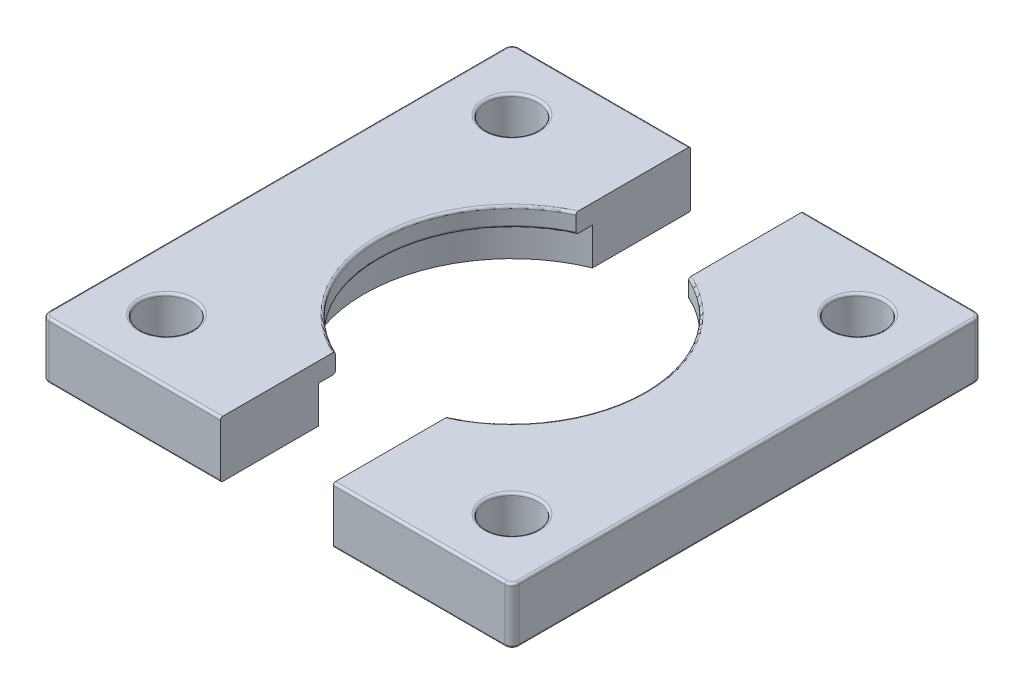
ISO-10303-21;
HEADER;
FILE_DESCRIPTION(('STEP AP214'),'2;1');
FILE_NAME('part.step','',(''),(''),'','','');
FILE_SCHEMA(('AUTOMOTIVE_DESIGN { 1 0 10303 214 1 1 1 1 }'));
ENDSEC;
DATA;
#1=APPLICATION_CONTEXT('core data for automotive mechanical design processes');
#2=APPLICATION_PROTOCOL_DEFINITION('international standard','automotive_design',2000,#1);
#3=PRODUCT_CONTEXT('',#1,'mechanical');
#4=PRODUCT('Part','Part','',(#3));
#5=PRODUCT_RELATED_PRODUCT_CATEGORY('part','',(#4));
#6=PRODUCT_DEFINITION_FORMATION('','',#4);
#7=PRODUCT_DEFINITION_CONTEXT('part definition',#1,'design');
#8=PRODUCT_DEFINITION('design','',#6,#7);
#9=PRODUCT_DEFINITION_SHAPE('','',#8);
#10=(LENGTH_UNIT() NAMED_UNIT(*) SI_UNIT(.MILLI.,.METRE.));
#11=(NAMED_UNIT(*) PLANE_ANGLE_UNIT() SI_UNIT($,.RADIAN.));
#12=(NAMED_UNIT(*) SI_UNIT($,.STERADIAN.) SOLID_ANGLE_UNIT());
#13=UNCERTAINTY_MEASURE_WITH_UNIT(LENGTH_MEASURE(1.E-05),#10,'distance_accuracy_value','');
#14=(GEOMETRIC_REPRESENTATION_CONTEXT(3) GLOBAL_UNCERTAINTY_ASSIGNED_CONTEXT((#13)) GLOBAL_UNIT_ASSIGNED_CONTEXT((#10,
#11,#12)) REPRESENTATION_CONTEXT('',''));
#15=CARTESIAN_POINT('',(0.,0.,0.));
#16=DIRECTION('',(0.,0.,1.));
#17=DIRECTION('',(1.,0.,0.));
#18=AXIS2_PLACEMENT_3D('',#15,#16,#17);
#19=CARTESIAN_POINT('',(0.,12.,0.));
#20=DIRECTION('',(0.,-1.,0.));
#21=DIRECTION('',(0.,0.,-1.));
#22=AXIS2_PLACEMENT_3D('',#19,#20,#21);
#23=CYLINDRICAL_SURFACE('',#22,28.25);
#24=DIRECTION('',(0.,-1.,0.));
#25=VECTOR('',#24,1.);
#26=CARTESIAN_POINT('',(12.,12.,-25.574645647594));
#27=LINE('',#26,#25);
#28=CARTESIAN_POINT('',(12.,11.5,-25.574645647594));
#29=VERTEX_POINT('',#28);
#30=CARTESIAN_POINT('',(12.,8.4,-25.574645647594));
#31=VERTEX_POINT('',#30);
#32=EDGE_CURVE('E226',#29,#31,#27,.T.);
#33=ORIENTED_EDGE('',*,*,#32,.T.);
#34=CARTESIAN_POINT('',(0.,8.4,0.));
#35=DIRECTION('',(0.,-1.,0.));
#36=DIRECTION('',(0.,0.,-1.));
#37=AXIS2_PLACEMENT_3D('',#34,#35,#36);
#38=CIRCLE('',#37,28.25);
#39=CARTESIAN_POINT('',(12.,8.4,25.574645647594));
#40=VERTEX_POINT('',#39);
#41=EDGE_CURVE('E407',#31,#40,#38,.T.);
#42=ORIENTED_EDGE('',*,*,#41,.T.);
#43=DIRECTION('',(0.,-1.,0.));
#44=VECTOR('',#43,1.);
#45=CARTESIAN_POINT('',(12.,12.,25.574645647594));
#46=LINE('',#45,#44);
#47=CARTESIAN_POINT('',(12.,11.5,25.574645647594));
#48=VERTEX_POINT('',#47);
#49=EDGE_CURVE('E223',#48,#40,#46,.T.);
#50=ORIENTED_EDGE('',*,*,#49,.F.);
#51=CARTESIAN_POINT('',(0.,11.5,0.));
#52=DIRECTION('',(0.,1.,0.));
#53=DIRECTION('',(0.,0.,1.));
#54=AXIS2_PLACEMENT_3D('',#51,#52,#53);
#55=CIRCLE('',#54,28.25);
#56=EDGE_CURVE('E68',#48,#29,#55,.T.);
#57=ORIENTED_EDGE('',*,*,#56,.T.);
#58=EDGE_LOOP('',(#33,#42,#50,#57));
#59=FACE_BOUND('',#58,.T.);
#60=ADVANCED_FACE('F44',(#59),#23,.F.);
#61=CARTESIAN_POINT('',(48.5,12.,48.5));
#62=DIRECTION('',(0.,1.,0.));
#63=DIRECTION('',(0.,0.,1.));
#64=AXIS2_PLACEMENT_3D('',#61,#62,#63);
#65=PLANE('',#64);
#66=CARTESIAN_POINT('',(36.75,12.,-36.75));
#67=DIRECTION('',(0.,1.,0.));
#68=DIRECTION('',(0.,0.,1.));
#69=AXIS2_PLACEMENT_3D('',#66,#67,#68);
#70=CIRCLE('',#69,5.99999999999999);
#71=CARTESIAN_POINT('',(36.75,12.,-30.75));
#72=VERTEX_POINT('',#71);
#73=EDGE_CURVE('E466',#72,#72,#70,.F.);
#74=ORIENTED_EDGE('',*,*,#73,.T.);
#75=EDGE_LOOP('',(#74));
#76=FACE_BOUND('',#75,.T.);
#77=CARTESIAN_POINT('',(36.75,12.,36.75));
#78=DIRECTION('',(0.,1.,0.));
#79=DIRECTION('',(0.,0.,1.));
#80=AXIS2_PLACEMENT_3D('',#77,#78,#79);
#81=CIRCLE('',#80,5.99999999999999);
#82=CARTESIAN_POINT('',(36.75,12.,42.75));
#83=VERTEX_POINT('',#82);
#84=EDGE_CURVE('E377',#83,#83,#81,.F.);
#85=ORIENTED_EDGE('',*,*,#84,.T.);
#86=EDGE_LOOP('',(#85));
#87=FACE_BOUND('',#86,.T.);
#88=DIRECTION('',(0.,0.,1.));
#89=VECTOR('',#88,1.);
#90=CARTESIAN_POINT('',(12.,12.,-50.));
#91=LINE('',#90,#89);
#92=CARTESIAN_POINT('',(12.,12.,-49.5));
#93=VERTEX_POINT('',#92);
#94=CARTESIAN_POINT('',(12.,12.,-26.1258971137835));
#95=VERTEX_POINT('',#94);
#96=EDGE_CURVE('E210',#93,#95,#91,.T.);
#97=ORIENTED_EDGE('',*,*,#96,.T.);
#98=CARTESIAN_POINT('',(0.,12.,0.));
#99=DIRECTION('',(0.,1.,0.));
#100=DIRECTION('',(0.,0.,1.));
#101=AXIS2_PLACEMENT_3D('',#98,#99,#100);
#102=CIRCLE('',#101,28.75);
#103=CARTESIAN_POINT('',(12.,12.,26.1258971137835));
#104=VERTEX_POINT('',#103);
#105=EDGE_CURVE('E421',#95,#104,#102,.F.);
#106=ORIENTED_EDGE('',*,*,#105,.T.);
#107=DIRECTION('',(0.,0.,1.));
#108=VECTOR('',#107,1.);
#109=CARTESIAN_POINT('',(12.,12.,25.574645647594));
#110=LINE('',#109,#108);
#111=CARTESIAN_POINT('',(12.,12.,49.5));
#112=VERTEX_POINT('',#111);
#113=EDGE_CURVE('E213',#104,#112,#110,.T.);
#114=ORIENTED_EDGE('',*,*,#113,.T.);
#115=DIRECTION('',(1.,0.,0.));
#116=VECTOR('',#115,1.);
#117=CARTESIAN_POINT('',(48.5,12.,49.5));
#118=LINE('',#117,#116);
#119=CARTESIAN_POINT('',(48.5,12.,49.5));
#120=VERTEX_POINT('',#119);
#121=EDGE_CURVE('E427',#112,#120,#118,.T.);
#122=ORIENTED_EDGE('',*,*,#121,.T.);
#123=CARTESIAN_POINT('',(48.5,12.,48.5));
#124=DIRECTION('',(0.,1.,0.));
#125=DIRECTION('',(0.,0.,1.));
#126=AXIS2_PLACEMENT_3D('',#123,#124,#125);
#127=CIRCLE('',#126,1.);
#128=CARTESIAN_POINT('',(49.5,12.,48.5));
#129=VERTEX_POINT('',#128);
#130=EDGE_CURVE('E431',#120,#129,#127,.T.);
#131=ORIENTED_EDGE('',*,*,#130,.T.);
#132=DIRECTION('',(0.,0.,-1.));
#133=VECTOR('',#132,1.);
#134=CARTESIAN_POINT('',(49.5,12.,-48.5));
#135=LINE('',#134,#133);
#136=CARTESIAN_POINT('',(49.5,12.,-48.5));
#137=VERTEX_POINT('',#136);
#138=EDGE_CURVE('E472',#129,#137,#135,.T.);
#139=ORIENTED_EDGE('',*,*,#138,.T.);
#140=CARTESIAN_POINT('',(48.5,12.,-48.5));
#141=DIRECTION('',(0.,1.,0.));
#142=DIRECTION('',(0.,0.,1.));
#143=AXIS2_PLACEMENT_3D('',#140,#141,#142);
#144=CIRCLE('',#143,1.);
#145=CARTESIAN_POINT('',(48.5,12.,-49.5));
#146=VERTEX_POINT('',#145);
#147=EDGE_CURVE('E470',#137,#146,#144,.T.);
#148=ORIENTED_EDGE('',*,*,#147,.T.);
#149=DIRECTION('',(-1.,0.,0.));
#150=VECTOR('',#149,1.);
#151=CARTESIAN_POINT('',(12.,12.,-49.5));
#152=LINE('',#151,#150);
#153=EDGE_CURVE('E440',#146,#93,#152,.T.);
#154=ORIENTED_EDGE('',*,*,#153,.T.);
#155=EDGE_LOOP('',(#97,#106,#114,#122,#131,#139,#148,#154));
#156=FACE_BOUND('',#155,.T.);
#157=ADVANCED_FACE('F285',(#76,#87,#156),#65,.T.);
#158=CARTESIAN_POINT('',(48.5,0.,48.5));
#159=DIRECTION('',(0.,1.,0.));
#160=DIRECTION('',(0.,0.,1.));
#161=AXIS2_PLACEMENT_3D('',#158,#159,#160);
#162=PLANE('',#161);
#163=CARTESIAN_POINT('',(36.75,0.,-36.75));
#164=DIRECTION('',(0.,1.,0.));
#165=DIRECTION('',(0.,0.,-1.));
#166=AXIS2_PLACEMENT_3D('',#163,#164,#165);
#167=CIRCLE('',#166,5.5);
#168=CARTESIAN_POINT('',(36.75,0.,-42.25));
#169=VERTEX_POINT('',#168);
#170=EDGE_CURVE('E182',#169,#169,#167,.T.);
#171=ORIENTED_EDGE('',*,*,#170,.T.);
#172=EDGE_LOOP('',(#171));
#173=FACE_BOUND('',#172,.T.);
#174=CARTESIAN_POINT('',(48.5,0.,48.5));
#175=DIRECTION('',(0.,1.,0.));
#176=DIRECTION('',(0.,0.,1.));
#177=AXIS2_PLACEMENT_3D('',#174,#175,#176);
#178=CIRCLE('',#177,1.);
#179=CARTESIAN_POINT('',(49.5,0.,48.5));
#180=VERTEX_POINT('',#179);
#181=CARTESIAN_POINT('',(48.5,0.,49.5));
#182=VERTEX_POINT('',#181);
#183=EDGE_CURVE('E255',#180,#182,#178,.F.);
#184=ORIENTED_EDGE('',*,*,#183,.T.);
#185=DIRECTION('',(1.,0.,0.));
#186=VECTOR('',#185,1.);
#187=CARTESIAN_POINT('',(48.5,0.,49.5));
#188=LINE('',#187,#186);
#189=CARTESIAN_POINT('',(12.,0.,49.5));
#190=VERTEX_POINT('',#189);
#191=EDGE_CURVE('E257',#182,#190,#188,.F.);
#192=ORIENTED_EDGE('',*,*,#191,.T.);
#193=DIRECTION('',(0.,0.,1.));
#194=VECTOR('',#193,1.);
#195=CARTESIAN_POINT('',(12.,0.,25.574645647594));
#196=LINE('',#195,#194);
#197=CARTESIAN_POINT('',(12.,0.,29.1247317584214));
#198=VERTEX_POINT('',#197);
#199=EDGE_CURVE('E181',#198,#190,#196,.T.);
#200=ORIENTED_EDGE('',*,*,#199,.F.);
#201=CARTESIAN_POINT('',(0.,0.,0.));
#202=DIRECTION('',(0.,-1.,0.));
#203=DIRECTION('',(0.,0.,-1.));
#204=AXIS2_PLACEMENT_3D('',#201,#202,#203);
#205=CIRCLE('',#204,31.5);
#206=CARTESIAN_POINT('',(12.,0.,-29.1247317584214));
#207=VERTEX_POINT('',#206);
#208=EDGE_CURVE('E188',#207,#198,#205,.T.);
#209=ORIENTED_EDGE('',*,*,#208,.F.);
#210=DIRECTION('',(0.,0.,1.));
#211=VECTOR('',#210,1.);
#212=CARTESIAN_POINT('',(12.,0.,-50.));
#213=LINE('',#212,#211);
#214=CARTESIAN_POINT('',(12.,0.,-49.5));
#215=VERTEX_POINT('',#214);
#216=EDGE_CURVE('E171',#215,#207,#213,.T.);
#217=ORIENTED_EDGE('',*,*,#216,.F.);
#218=DIRECTION('',(-1.,0.,0.));
#219=VECTOR('',#218,1.);
#220=CARTESIAN_POINT('',(48.5,0.,-49.5));
#221=LINE('',#220,#219);
#222=CARTESIAN_POINT('',(48.5,0.,-49.5));
#223=VERTEX_POINT('',#222);
#224=EDGE_CURVE('E249',#215,#223,#221,.F.);
#225=ORIENTED_EDGE('',*,*,#224,.T.);
#226=CARTESIAN_POINT('',(48.5,0.,-48.5));
#227=DIRECTION('',(0.,1.,0.));
#228=DIRECTION('',(0.,0.,1.));
#229=AXIS2_PLACEMENT_3D('',#226,#227,#228);
#230=CIRCLE('',#229,1.);
#231=CARTESIAN_POINT('',(49.5,0.,-48.5));
#232=VERTEX_POINT('',#231);
#233=EDGE_CURVE('E251',#223,#232,#230,.F.);
#234=ORIENTED_EDGE('',*,*,#233,.T.);
#235=DIRECTION('',(0.,0.,-1.));
#236=VECTOR('',#235,1.);
#237=CARTESIAN_POINT('',(49.5,0.,48.5));
#238=LINE('',#237,#236);
#239=EDGE_CURVE('E253',#232,#180,#238,.F.);
#240=ORIENTED_EDGE('',*,*,#239,.T.);
#241=EDGE_LOOP('',(#184,#192,#200,#209,#217,#225,#234,#240));
#242=FACE_BOUND('',#241,.T.);
#243=CARTESIAN_POINT('',(36.75,0.,36.75));
#244=DIRECTION('',(0.,1.,0.));
#245=DIRECTION('',(0.,0.,1.));
#246=AXIS2_PLACEMENT_3D('',#243,#244,#245);
#247=CIRCLE('',#246,5.5);
#248=CARTESIAN_POINT('',(36.75,0.,42.25));
#249=VERTEX_POINT('',#248);
#250=EDGE_CURVE('E191',#249,#249,#247,.T.);
#251=ORIENTED_EDGE('',*,*,#250,.T.);
#252=EDGE_LOOP('',(#251));
#253=FACE_BOUND('',#252,.T.);
#254=ADVANCED_FACE('F195',(#173,#242,#253),#162,.F.);
#255=CARTESIAN_POINT('',(48.5,12.,48.5));
#256=DIRECTION('',(0.,-1.,0.));
#257=DIRECTION('',(0.,0.,-1.));
#258=AXIS2_PLACEMENT_3D('',#255,#256,#257);
#259=CYLINDRICAL_SURFACE('',#258,1.5);
#260=DIRECTION('',(0.,-1.,0.));
#261=VECTOR('',#260,1.);
#262=CARTESIAN_POINT('',(48.5,12.,50.));
#263=LINE('',#262,#261);
#264=CARTESIAN_POINT('',(48.5,11.5,50.));
#265=VERTEX_POINT('',#264);
#266=CARTESIAN_POINT('',(48.5,0.5,50.));
#267=VERTEX_POINT('',#266);
#268=EDGE_CURVE('E215',#265,#267,#263,.T.);
#269=ORIENTED_EDGE('',*,*,#268,.T.);
#270=CARTESIAN_POINT('',(48.5,0.5,48.5));
#271=DIRECTION('',(0.,1.,0.));
#272=DIRECTION('',(0.,0.,1.));
#273=AXIS2_PLACEMENT_3D('',#270,#271,#272);
#274=CIRCLE('',#273,1.5);
#275=CARTESIAN_POINT('',(50.,0.5,48.5));
#276=VERTEX_POINT('',#275);
#277=EDGE_CURVE('E443',#267,#276,#274,.T.);
#278=ORIENTED_EDGE('',*,*,#277,.T.);
#279=DIRECTION('',(0.,-1.,0.));
#280=VECTOR('',#279,1.);
#281=CARTESIAN_POINT('',(50.,12.,48.5));
#282=LINE('',#281,#280);
#283=CARTESIAN_POINT('',(50.,11.5,48.5));
#284=VERTEX_POINT('',#283);
#285=EDGE_CURVE('E236',#284,#276,#282,.T.);
#286=ORIENTED_EDGE('',*,*,#285,.F.);
#287=CARTESIAN_POINT('',(48.5,11.5,48.5));
#288=DIRECTION('',(0.,1.,0.));
#289=DIRECTION('',(0.,0.,1.));
#290=AXIS2_PLACEMENT_3D('',#287,#288,#289);
#291=CIRCLE('',#290,1.5);
#292=EDGE_CURVE('E446',#284,#265,#291,.F.);
#293=ORIENTED_EDGE('',*,*,#292,.T.);
#294=EDGE_LOOP('',(#269,#278,#286,#293));
#295=FACE_BOUND('',#294,.T.);
#296=ADVANCED_FACE('F351',(#295),#259,.T.);
#297=CARTESIAN_POINT('',(50.,12.,-48.5));
#298=DIRECTION('',(-1.,0.,0.));
#299=DIRECTION('',(0.,0.,1.));
#300=AXIS2_PLACEMENT_3D('',#297,#298,#299);
#301=PLANE('',#300);
#302=ORIENTED_EDGE('',*,*,#285,.T.);
#303=DIRECTION('',(0.,0.,-1.));
#304=VECTOR('',#303,1.);
#305=CARTESIAN_POINT('',(50.,0.5,-48.5));
#306=LINE('',#305,#304);
#307=CARTESIAN_POINT('',(50.,0.5,-48.5));
#308=VERTEX_POINT('',#307);
#309=EDGE_CURVE('E381',#276,#308,#306,.T.);
#310=ORIENTED_EDGE('',*,*,#309,.T.);
#311=DIRECTION('',(0.,-1.,0.));
#312=VECTOR('',#311,1.);
#313=CARTESIAN_POINT('',(50.,12.,-48.5));
#314=LINE('',#313,#312);
#315=CARTESIAN_POINT('',(50.,11.5,-48.5));
#316=VERTEX_POINT('',#315);
#317=EDGE_CURVE('E233',#316,#308,#314,.T.);
#318=ORIENTED_EDGE('',*,*,#317,.F.);
#319=DIRECTION('',(0.,0.,-1.));
#320=VECTOR('',#319,1.);
#321=CARTESIAN_POINT('',(50.,11.5,48.5));
#322=LINE('',#321,#320);
#323=EDGE_CURVE('E445',#316,#284,#322,.F.);
#324=ORIENTED_EDGE('',*,*,#323,.T.);
#325=EDGE_LOOP('',(#302,#310,#318,#324));
#326=FACE_BOUND('',#325,.T.);
#327=ADVANCED_FACE('F354',(#326),#301,.F.);
#328=CARTESIAN_POINT('',(48.5,12.,-48.5));
#329=DIRECTION('',(0.,-1.,0.));
#330=DIRECTION('',(0.,0.,-1.));
#331=AXIS2_PLACEMENT_3D('',#328,#329,#330);
#332=CYLINDRICAL_SURFACE('',#331,1.5);
#333=ORIENTED_EDGE('',*,*,#317,.T.);
#334=CARTESIAN_POINT('',(48.5,0.5,-48.5));
#335=DIRECTION('',(0.,1.,0.));
#336=DIRECTION('',(0.,0.,1.));
#337=AXIS2_PLACEMENT_3D('',#334,#335,#336);
#338=CIRCLE('',#337,1.5);
#339=CARTESIAN_POINT('',(48.5,0.5,-50.));
#340=VERTEX_POINT('',#339);
#341=EDGE_CURVE('E368',#308,#340,#338,.T.);
#342=ORIENTED_EDGE('',*,*,#341,.T.);
#343=DIRECTION('',(0.,-1.,0.));
#344=VECTOR('',#343,1.);
#345=CARTESIAN_POINT('',(48.5,12.,-50.));
#346=LINE('',#345,#344);
#347=CARTESIAN_POINT('',(48.5,11.5,-50.));
#348=VERTEX_POINT('',#347);
#349=EDGE_CURVE('E230',#348,#340,#346,.T.);
#350=ORIENTED_EDGE('',*,*,#349,.F.);
#351=CARTESIAN_POINT('',(48.5,11.5,-48.5));
#352=DIRECTION('',(0.,1.,0.));
#353=DIRECTION('',(0.,0.,1.));
#354=AXIS2_PLACEMENT_3D('',#351,#352,#353);
#355=CIRCLE('',#354,1.5);
#356=EDGE_CURVE('E370',#348,#316,#355,.F.);
#357=ORIENTED_EDGE('',*,*,#356,.T.);
#358=EDGE_LOOP('',(#333,#342,#350,#357));
#359=FACE_BOUND('',#358,.T.);
#360=ADVANCED_FACE('F357',(#359),#332,.T.);
#361=CARTESIAN_POINT('',(12.,12.,-50.));
#362=DIRECTION('',(0.,0.,1.));
#363=DIRECTION('',(1.,0.,0.));
#364=AXIS2_PLACEMENT_3D('',#361,#362,#363);
#365=PLANE('',#364);
#366=ORIENTED_EDGE('',*,*,#349,.T.);
#367=DIRECTION('',(-1.,0.,0.));
#368=VECTOR('',#367,1.);
#369=CARTESIAN_POINT('',(12.,0.5,-50.));
#370=LINE('',#369,#368);
#371=CARTESIAN_POINT('',(12.,0.5,-50.));
#372=VERTEX_POINT('',#371);
#373=EDGE_CURVE('E429',#340,#372,#370,.T.);
#374=ORIENTED_EDGE('',*,*,#373,.T.);
#375=DIRECTION('',(0.,-1.,0.));
#376=VECTOR('',#375,1.);
#377=CARTESIAN_POINT('',(12.,12.,-50.));
#378=LINE('',#377,#376);
#379=CARTESIAN_POINT('',(12.,11.5,-50.));
#380=VERTEX_POINT('',#379);
#381=EDGE_CURVE('E228',#380,#372,#378,.T.);
#382=ORIENTED_EDGE('',*,*,#381,.F.);
#383=DIRECTION('',(-1.,0.,0.));
#384=VECTOR('',#383,1.);
#385=CARTESIAN_POINT('',(48.5,11.5,-50.));
#386=LINE('',#385,#384);
#387=EDGE_CURVE('E426',#380,#348,#386,.F.);
#388=ORIENTED_EDGE('',*,*,#387,.T.);
#389=EDGE_LOOP('',(#366,#374,#382,#388));
#390=FACE_BOUND('',#389,.T.);
#391=ADVANCED_FACE('F289',(#390),#365,.F.);
#392=CARTESIAN_POINT('',(12.,12.,-50.));
#393=DIRECTION('',(1.,0.,0.));
#394=DIRECTION('',(0.,0.,-1.));
#395=AXIS2_PLACEMENT_3D('',#392,#393,#394);
#396=PLANE('',#395);
#397=ORIENTED_EDGE('',*,*,#381,.T.);
#398=CARTESIAN_POINT('',(12.,0.5,-49.5));
#399=DIRECTION('',(1.,0.,0.));
#400=DIRECTION('',(0.,0.,-1.));
#401=AXIS2_PLACEMENT_3D('',#398,#399,#400);
#402=CIRCLE('',#401,0.5);
#403=EDGE_CURVE('E177',#372,#215,#402,.F.);
#404=ORIENTED_EDGE('',*,*,#403,.T.);
#405=ORIENTED_EDGE('',*,*,#216,.T.);
#406=DIRECTION('',(0.,-1.,0.));
#407=VECTOR('',#406,1.);
#408=CARTESIAN_POINT('',(12.,7.9,-29.1247317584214));
#409=LINE('',#408,#407);
#410=CARTESIAN_POINT('',(12.,7.9,-29.1247317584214));
#411=VERTEX_POINT('',#410);
#412=EDGE_CURVE('E175',#207,#411,#409,.F.);
#413=ORIENTED_EDGE('',*,*,#412,.T.);
#414=DIRECTION('',(0.,0.,-1.));
#415=VECTOR('',#414,1.);
#416=CARTESIAN_POINT('',(12.,7.9,-50.));
#417=LINE('',#416,#415);
#418=CARTESIAN_POINT('',(12.,7.9,-26.1258971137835));
#419=VERTEX_POINT('',#418);
#420=EDGE_CURVE('E192',#419,#411,#417,.T.);
#421=ORIENTED_EDGE('',*,*,#420,.F.);
#422=CARTESIAN_POINT('',(12.,7.9,-26.1258971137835));
#423=CARTESIAN_POINT('',(12.,7.89998832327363,-26.0924549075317));
#424=CARTESIAN_POINT('',(12.,7.90277064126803,-26.0590023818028));
#425=CARTESIAN_POINT('',(12.,7.91384736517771,-25.992941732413));
#426=CARTESIAN_POINT('',(12.,7.92215501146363,-25.9603358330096));
#427=CARTESIAN_POINT('',(12.,7.94422141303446,-25.896958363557));
#428=CARTESIAN_POINT('',(12.,7.95798791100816,-25.8661894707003));
#429=CARTESIAN_POINT('',(12.,7.99075109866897,-25.8075946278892));
#430=CARTESIAN_POINT('',(12.,8.00974235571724,-25.779765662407));
#431=CARTESIAN_POINT('',(12.,8.05147873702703,-25.7294565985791));
#432=CARTESIAN_POINT('',(12.,8.07397970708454,-25.7067746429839));
#433=CARTESIAN_POINT('',(12.,8.12283799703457,-25.6659981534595));
#434=CARTESIAN_POINT('',(12.,8.14919439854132,-25.6479025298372));
#435=CARTESIAN_POINT('',(12.,8.202249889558,-25.618718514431));
#436=CARTESIAN_POINT('',(12.,8.22867032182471,-25.6071223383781));
#437=CARTESIAN_POINT('',(12.,8.28317512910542,-25.5890182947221));
#438=CARTESIAN_POINT('',(12.,8.31125576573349,-25.5824994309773));
#439=CARTESIAN_POINT('',(12.,8.34966368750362,-25.577337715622));
#440=CARTESIAN_POINT('',(12.,8.35971202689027,-25.5763282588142));
#441=CARTESIAN_POINT('',(12.,8.37983848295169,-25.5749830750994));
#442=CARTESIAN_POINT('',(12.,8.38991653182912,-25.5746463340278));
#443=CARTESIAN_POINT('',(12.,8.4,-25.574645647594));
#444=B_SPLINE_CURVE_WITH_KNOTS('',3,(#422,#423,#424,#425,#426,#427,#428,#429,#430,#431,#432,
#433,#434,#435,#436,#437,#438,#439,#440,#441,#442,#443),.UNSPECIFIED.,.F.,.F.,(4,2,2,2,2,2,2,2,
2,2,4),(0.,0.100229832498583,0.200700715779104,0.301314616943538,0.401824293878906,
0.497149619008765,0.592452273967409,0.678555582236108,0.764471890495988,0.794751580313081,
0.824985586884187),.UNSPECIFIED.);
#445=EDGE_CURVE('E61',#419,#31,#444,.T.);
#446=ORIENTED_EDGE('',*,*,#445,.T.);
#447=ORIENTED_EDGE('',*,*,#32,.F.);
#448=CARTESIAN_POINT('',(12.,11.5,-25.574645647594));
#449=CARTESIAN_POINT('',(12.,11.5262320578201,-25.5746111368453));
#450=CARTESIAN_POINT('',(12.,11.5524412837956,-25.5769235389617));
#451=CARTESIAN_POINT('',(12.,11.6039984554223,-25.5859678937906));
#452=CARTESIAN_POINT('',(12.,11.6293490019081,-25.5926849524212));
#453=CARTESIAN_POINT('',(12.,11.6785478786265,-25.6102634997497));
#454=CARTESIAN_POINT('',(12.,11.7023969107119,-25.6211230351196));
#455=CARTESIAN_POINT('',(12.,11.7480365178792,-25.6465466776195));
#456=CARTESIAN_POINT('',(12.,11.769825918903,-25.6611128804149));
#457=CARTESIAN_POINT('',(12.,11.8116758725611,-25.6940630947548));
#458=CARTESIAN_POINT('',(12.,11.8316371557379,-25.7125728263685));
#459=CARTESIAN_POINT('',(12.,11.8684799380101,-25.7524309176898));
#460=CARTESIAN_POINT('',(12.,11.8853606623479,-25.7737799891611));
#461=CARTESIAN_POINT('',(12.,11.91716645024,-25.8207415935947));
#462=CARTESIAN_POINT('',(12.,11.9317802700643,-25.8465647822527));
#463=CARTESIAN_POINT('',(12.,11.9568713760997,-25.9001575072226));
#464=CARTESIAN_POINT('',(12.,11.9673460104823,-25.9279282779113));
#465=CARTESIAN_POINT('',(12.,11.9837738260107,-25.9838305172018));
#466=CARTESIAN_POINT('',(12.,11.9898574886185,-26.011923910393));
#467=CARTESIAN_POINT('',(12.,11.9979702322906,-26.0686456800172));
#468=CARTESIAN_POINT('',(12.,12.0000056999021,-26.0972731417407));
#469=CARTESIAN_POINT('',(12.,12.,-26.1258971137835));
#470=B_SPLINE_CURVE_WITH_KNOTS('',3,(#448,#449,#450,#451,#452,#453,#454,#455,#456,#457,#458,
#459,#460,#461,#462,#463,#464,#465,#466,#467,#468,#469),.UNSPECIFIED.,.F.,.F.,(4,2,2,2,2,2,2,2,
2,2,4),(0.,0.0785588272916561,0.156853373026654,0.235111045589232,0.313413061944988,
0.394739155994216,0.476085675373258,0.564728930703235,0.65342888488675,0.739370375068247,
0.825176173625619),.UNSPECIFIED.);
#471=EDGE_CURVE('E293',#29,#95,#470,.T.);
#472=ORIENTED_EDGE('',*,*,#471,.T.);
#473=ORIENTED_EDGE('',*,*,#96,.F.);
#474=CARTESIAN_POINT('',(12.,11.5,-49.5));
#475=DIRECTION('',(1.,0.,0.));
#476=DIRECTION('',(0.,0.,-1.));
#477=AXIS2_PLACEMENT_3D('',#474,#475,#476);
#478=CIRCLE('',#477,0.5);
#479=EDGE_CURVE('E435',#93,#380,#478,.F.);
#480=ORIENTED_EDGE('',*,*,#479,.T.);
#481=EDGE_LOOP('',(#397,#404,#405,#413,#421,#446,#447,#472,#473,#480));
#482=FACE_BOUND('',#481,.T.);
#483=ADVANCED_FACE('F174',(#482),#396,.F.);
#484=CARTESIAN_POINT('',(12.,12.,25.574645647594));
#485=DIRECTION('',(1.,0.,0.));
#486=DIRECTION('',(0.,0.,-1.));
#487=AXIS2_PLACEMENT_3D('',#484,#485,#486);
#488=PLANE('',#487);
#489=ORIENTED_EDGE('',*,*,#199,.T.);
#490=CARTESIAN_POINT('',(12.,0.5,49.5));
#491=DIRECTION('',(1.,0.,0.));
#492=DIRECTION('',(0.,0.,-1.));
#493=AXIS2_PLACEMENT_3D('',#490,#491,#492);
#494=CIRCLE('',#493,0.5);
#495=CARTESIAN_POINT('',(12.,0.5,50.));
#496=VERTEX_POINT('',#495);
#497=EDGE_CURVE('E456',#190,#496,#494,.F.);
#498=ORIENTED_EDGE('',*,*,#497,.T.);
#499=DIRECTION('',(0.,-1.,0.));
#500=VECTOR('',#499,1.);
#501=CARTESIAN_POINT('',(12.,12.,50.));
#502=LINE('',#501,#500);
#503=CARTESIAN_POINT('',(12.,11.5,50.));
#504=VERTEX_POINT('',#503);
#505=EDGE_CURVE('E220',#504,#496,#502,.T.);
#506=ORIENTED_EDGE('',*,*,#505,.F.);
#507=CARTESIAN_POINT('',(12.,11.5,49.5));
#508=DIRECTION('',(1.,0.,0.));
#509=DIRECTION('',(0.,0.,-1.));
#510=AXIS2_PLACEMENT_3D('',#507,#508,#509);
#511=CIRCLE('',#510,0.5);
#512=EDGE_CURVE('E458',#504,#112,#511,.F.);
#513=ORIENTED_EDGE('',*,*,#512,.T.);
#514=ORIENTED_EDGE('',*,*,#113,.F.);
#515=CARTESIAN_POINT('',(12.,12.,26.1258971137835));
#516=CARTESIAN_POINT('',(12.,12.0000116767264,26.0924549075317));
#517=CARTESIAN_POINT('',(12.,11.997229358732,26.0590023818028));
#518=CARTESIAN_POINT('',(12.,11.9861526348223,25.992941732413));
#519=CARTESIAN_POINT('',(12.,11.9778449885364,25.9603358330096));
#520=CARTESIAN_POINT('',(12.,11.9557785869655,25.896958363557));
#521=CARTESIAN_POINT('',(12.,11.9420120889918,25.8661894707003));
#522=CARTESIAN_POINT('',(12.,11.909248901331,25.8075946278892));
#523=CARTESIAN_POINT('',(12.,11.8902576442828,25.779765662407));
#524=CARTESIAN_POINT('',(12.,11.848521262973,25.7294565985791));
#525=CARTESIAN_POINT('',(12.,11.8260202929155,25.7067746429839));
#526=CARTESIAN_POINT('',(12.,11.7771620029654,25.6659981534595));
#527=CARTESIAN_POINT('',(12.,11.7508056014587,25.6479025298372));
#528=CARTESIAN_POINT('',(12.,11.697750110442,25.618718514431));
#529=CARTESIAN_POINT('',(12.,11.6713296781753,25.6071223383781));
#530=CARTESIAN_POINT('',(12.,11.6168248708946,25.5890182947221));
#531=CARTESIAN_POINT('',(12.,11.5887442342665,25.5824994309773));
#532=CARTESIAN_POINT('',(12.,11.5503363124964,25.577337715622));
#533=CARTESIAN_POINT('',(12.,11.5402879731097,25.5763282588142));
#534=CARTESIAN_POINT('',(12.,11.5201615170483,25.5749830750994));
#535=CARTESIAN_POINT('',(12.,11.5100834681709,25.5746463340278));
#536=CARTESIAN_POINT('',(12.,11.5,25.574645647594));
#537=B_SPLINE_CURVE_WITH_KNOTS('',3,(#515,#516,#517,#518,#519,#520,#521,#522,#523,#524,#525,
#526,#527,#528,#529,#530,#531,#532,#533,#534,#535,#536),.UNSPECIFIED.,.F.,.F.,(4,2,2,2,2,2,2,2,
2,2,4),(0.,0.100229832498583,0.200700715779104,0.301314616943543,0.401824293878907,
0.497149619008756,0.592452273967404,0.678555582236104,0.764471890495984,0.794751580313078,
0.824985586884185),.UNSPECIFIED.);
#538=EDGE_CURVE('E259',#104,#48,#537,.T.);
#539=ORIENTED_EDGE('',*,*,#538,.T.);
#540=ORIENTED_EDGE('',*,*,#49,.T.);
#541=CARTESIAN_POINT('',(12.,8.4,25.574645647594));
#542=CARTESIAN_POINT('',(12.,8.37376794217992,25.5746111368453));
#543=CARTESIAN_POINT('',(12.,8.34755871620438,25.5769235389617));
#544=CARTESIAN_POINT('',(12.,8.29600154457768,25.5859678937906));
#545=CARTESIAN_POINT('',(12.,8.27065099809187,25.5926849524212));
#546=CARTESIAN_POINT('',(12.,8.22145212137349,25.6102634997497));
#547=CARTESIAN_POINT('',(12.,8.19760308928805,25.6211230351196));
#548=CARTESIAN_POINT('',(12.,8.15196348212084,25.6465466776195));
#549=CARTESIAN_POINT('',(12.,8.13017408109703,25.6611128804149));
#550=CARTESIAN_POINT('',(12.,8.0883241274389,25.6940630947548));
#551=CARTESIAN_POINT('',(12.,8.06836284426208,25.7125728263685));
#552=CARTESIAN_POINT('',(12.,8.03152006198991,25.7524309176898));
#553=CARTESIAN_POINT('',(12.,8.01463933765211,25.7737799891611));
#554=CARTESIAN_POINT('',(12.,7.98283354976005,25.8207415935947));
#555=CARTESIAN_POINT('',(12.,7.96821972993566,25.8465647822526));
#556=CARTESIAN_POINT('',(12.,7.94312862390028,25.9001575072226));
#557=CARTESIAN_POINT('',(12.,7.93265398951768,25.9279282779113));
#558=CARTESIAN_POINT('',(12.,7.91622617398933,25.9838305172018));
#559=CARTESIAN_POINT('',(12.,7.91014251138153,26.011923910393));
#560=CARTESIAN_POINT('',(12.,7.90202976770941,26.0686456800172));
#561=CARTESIAN_POINT('',(12.,7.89999430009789,26.0972731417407));
#562=CARTESIAN_POINT('',(12.,7.9,26.1258971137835));
#563=B_SPLINE_CURVE_WITH_KNOTS('',3,(#541,#542,#543,#544,#545,#546,#547,#548,#549,#550,#551,
#552,#553,#554,#555,#556,#557,#558,#559,#560,#561,#562),.UNSPECIFIED.,.F.,.F.,(4,2,2,2,2,2,2,2,
2,2,4),(0.,0.0785588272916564,0.156853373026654,0.235111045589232,0.31341306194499,
0.394739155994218,0.476085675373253,0.564728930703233,0.653428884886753,0.73937037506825,
0.825176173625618),.UNSPECIFIED.);
#564=CARTESIAN_POINT('',(12.,7.9,26.1258971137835));
#565=VERTEX_POINT('',#564);
#566=EDGE_CURVE('E266',#40,#565,#563,.T.);
#567=ORIENTED_EDGE('',*,*,#566,.T.);
#568=DIRECTION('',(0.,0.,-1.));
#569=VECTOR('',#568,1.);
#570=CARTESIAN_POINT('',(12.,7.9,25.574645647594));
#571=LINE('',#570,#569);
#572=CARTESIAN_POINT('',(12.,7.9,29.1247317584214));
#573=VERTEX_POINT('',#572);
#574=EDGE_CURVE('E239',#573,#565,#571,.T.);
#575=ORIENTED_EDGE('',*,*,#574,.F.);
#576=DIRECTION('',(0.,-1.,0.));
#577=VECTOR('',#576,1.);
#578=CARTESIAN_POINT('',(12.,7.9,29.1247317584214));
#579=LINE('',#578,#577);
#580=EDGE_CURVE('E242',#573,#198,#579,.T.);
#581=ORIENTED_EDGE('',*,*,#580,.T.);
#582=EDGE_LOOP('',(#489,#498,#506,#513,#514,#539,#540,#567,#575,#581));
#583=FACE_BOUND('',#582,.T.);
#584=ADVANCED_FACE('F274',(#583),#488,.F.);
#585=CARTESIAN_POINT('',(12.,12.,50.));
#586=DIRECTION('',(0.,0.,-1.));
#587=DIRECTION('',(-1.,0.,0.));
#588=AXIS2_PLACEMENT_3D('',#585,#586,#587);
#589=PLANE('',#588);
#590=ORIENTED_EDGE('',*,*,#505,.T.);
#591=DIRECTION('',(1.,0.,0.));
#592=VECTOR('',#591,1.);
#593=CARTESIAN_POINT('',(12.,0.5,50.));
#594=LINE('',#593,#592);
#595=EDGE_CURVE('E246',#496,#267,#594,.T.);
#596=ORIENTED_EDGE('',*,*,#595,.T.);
#597=ORIENTED_EDGE('',*,*,#268,.F.);
#598=DIRECTION('',(1.,0.,0.));
#599=VECTOR('',#598,1.);
#600=CARTESIAN_POINT('',(12.,11.5,50.));
#601=LINE('',#600,#599);
#602=EDGE_CURVE('E244',#265,#504,#601,.F.);
#603=ORIENTED_EDGE('',*,*,#602,.T.);
#604=EDGE_LOOP('',(#590,#596,#597,#603));
#605=FACE_BOUND('',#604,.T.);
#606=ADVANCED_FACE('F279',(#605),#589,.F.);
#607=CARTESIAN_POINT('',(36.75,12.,-36.75));
#608=DIRECTION('',(0.,-1.,0.));
#609=DIRECTION('',(0.,0.,-1.));
#610=AXIS2_PLACEMENT_3D('',#607,#608,#609);
#611=CYLINDRICAL_SURFACE('',#610,5.5);
#612=CARTESIAN_POINT('',(36.75,11.5,-36.75));
#613=DIRECTION('',(0.,1.,0.));
#614=DIRECTION('',(0.,0.,1.));
#615=AXIS2_PLACEMENT_3D('',#612,#613,#614);
#616=CIRCLE('',#615,5.5);
#617=CARTESIAN_POINT('',(36.75,11.5,-31.25));
#618=VERTEX_POINT('',#617);
#619=EDGE_CURVE('E53',#618,#618,#616,.T.);
#620=ORIENTED_EDGE('',*,*,#619,.T.);
#621=EDGE_LOOP('',(#620));
#622=FACE_BOUND('',#621,.T.);
#623=ORIENTED_EDGE('',*,*,#170,.F.);
#624=EDGE_LOOP('',(#623));
#625=FACE_BOUND('',#624,.T.);
#626=ADVANCED_FACE('F484',(#622,#625),#611,.F.);
#627=CARTESIAN_POINT('',(36.75,12.,36.75));
#628=DIRECTION('',(0.,-1.,0.));
#629=DIRECTION('',(0.,0.,-1.));
#630=AXIS2_PLACEMENT_3D('',#627,#628,#629);
#631=CYLINDRICAL_SURFACE('',#630,5.5);
#632=CARTESIAN_POINT('',(36.75,11.5,36.75));
#633=DIRECTION('',(0.,1.,0.));
#634=DIRECTION('',(0.,0.,1.));
#635=AXIS2_PLACEMENT_3D('',#632,#633,#634);
#636=CIRCLE('',#635,5.5);
#637=CARTESIAN_POINT('',(36.75,11.5,42.25));
#638=VERTEX_POINT('',#637);
#639=EDGE_CURVE('E12',#638,#638,#636,.T.);
#640=ORIENTED_EDGE('',*,*,#639,.T.);
#641=EDGE_LOOP('',(#640));
#642=FACE_BOUND('',#641,.T.);
#643=ORIENTED_EDGE('',*,*,#250,.F.);
#644=EDGE_LOOP('',(#643));
#645=FACE_BOUND('',#644,.T.);
#646=ADVANCED_FACE('F487',(#642,#645),#631,.F.);
#647=CARTESIAN_POINT('',(0.,7.9,0.));
#648=DIRECTION('',(0.,-1.,0.));
#649=DIRECTION('',(0.,0.,-1.));
#650=AXIS2_PLACEMENT_3D('',#647,#648,#649);
#651=CYLINDRICAL_SURFACE('',#650,31.5);
#652=ORIENTED_EDGE('',*,*,#208,.T.);
#653=ORIENTED_EDGE('',*,*,#580,.F.);
#654=CARTESIAN_POINT('',(0.,7.9,0.));
#655=DIRECTION('',(0.,-1.,0.));
#656=DIRECTION('',(0.,0.,-1.));
#657=AXIS2_PLACEMENT_3D('',#654,#655,#656);
#658=CIRCLE('',#657,31.5);
#659=EDGE_CURVE('E190',#411,#573,#658,.T.);
#660=ORIENTED_EDGE('',*,*,#659,.F.);
#661=ORIENTED_EDGE('',*,*,#412,.F.);
#662=EDGE_LOOP('',(#652,#653,#660,#661));
#663=FACE_BOUND('',#662,.T.);
#664=ADVANCED_FACE('F186',(#663),#651,.F.);
#665=CARTESIAN_POINT('',(0.,7.9,0.));
#666=DIRECTION('',(0.,-1.,0.));
#667=DIRECTION('',(0.,0.,-1.));
#668=AXIS2_PLACEMENT_3D('',#665,#666,#667);
#669=PLANE('',#668);
#670=ORIENTED_EDGE('',*,*,#574,.T.);
#671=CARTESIAN_POINT('',(0.,7.9,0.));
#672=DIRECTION('',(0.,-1.,0.));
#673=DIRECTION('',(0.,0.,-1.));
#674=AXIS2_PLACEMENT_3D('',#671,#672,#673);
#675=CIRCLE('',#674,28.75);
#676=EDGE_CURVE('E409',#565,#419,#675,.F.);
#677=ORIENTED_EDGE('',*,*,#676,.T.);
#678=ORIENTED_EDGE('',*,*,#420,.T.);
#679=ORIENTED_EDGE('',*,*,#659,.T.);
#680=EDGE_LOOP('',(#670,#677,#678,#679));
#681=FACE_BOUND('',#680,.T.);
#682=ADVANCED_FACE('F335',(#681),#669,.T.);
#683=CARTESIAN_POINT('',(12.,0.5,-49.5));
#684=DIRECTION('',(-1.,0.,0.));
#685=DIRECTION('',(0.,0.,1.));
#686=AXIS2_PLACEMENT_3D('',#683,#684,#685);
#687=CYLINDRICAL_SURFACE('',#686,0.5);
#688=ORIENTED_EDGE('',*,*,#403,.F.);
#689=ORIENTED_EDGE('',*,*,#373,.F.);
#690=CARTESIAN_POINT('',(48.5,0.5,-49.5));
#691=DIRECTION('',(1.,0.,0.));
#692=DIRECTION('',(0.,0.,-1.));
#693=AXIS2_PLACEMENT_3D('',#690,#691,#692);
#694=CIRCLE('',#693,0.5);
#695=EDGE_CURVE('E198',#223,#340,#694,.T.);
#696=ORIENTED_EDGE('',*,*,#695,.F.);
#697=ORIENTED_EDGE('',*,*,#224,.F.);
#698=EDGE_LOOP('',(#688,#689,#696,#697));
#699=FACE_BOUND('',#698,.T.);
#700=ADVANCED_FACE('F331',(#699),#687,.T.);
#701=CARTESIAN_POINT('',(48.5,0.5,-48.5));
#702=DIRECTION('',(0.,1.,0.));
#703=DIRECTION('',(0.,0.,1.));
#704=AXIS2_PLACEMENT_3D('',#701,#702,#703);
#705=TOROIDAL_SURFACE('',#704,1.,0.5);
#706=ORIENTED_EDGE('',*,*,#695,.T.);
#707=ORIENTED_EDGE('',*,*,#341,.F.);
#708=CARTESIAN_POINT('',(49.5,0.5,-48.5));
#709=DIRECTION('',(0.,0.,1.));
#710=DIRECTION('',(1.,0.,0.));
#711=AXIS2_PLACEMENT_3D('',#708,#709,#710);
#712=CIRCLE('',#711,0.5);
#713=EDGE_CURVE('E202',#232,#308,#712,.T.);
#714=ORIENTED_EDGE('',*,*,#713,.F.);
#715=ORIENTED_EDGE('',*,*,#233,.F.);
#716=EDGE_LOOP('',(#706,#707,#714,#715));
#717=FACE_BOUND('',#716,.T.);
#718=ADVANCED_FACE('F334',(#717),#705,.T.);
#719=CARTESIAN_POINT('',(49.5,0.5,-48.5));
#720=DIRECTION('',(0.,0.,-1.));
#721=DIRECTION('',(-1.,0.,0.));
#722=AXIS2_PLACEMENT_3D('',#719,#720,#721);
#723=CYLINDRICAL_SURFACE('',#722,0.5);
#724=ORIENTED_EDGE('',*,*,#713,.T.);
#725=ORIENTED_EDGE('',*,*,#309,.F.);
#726=CARTESIAN_POINT('',(49.5,0.5,48.5));
#727=DIRECTION('',(0.,0.,1.));
#728=DIRECTION('',(1.,0.,0.));
#729=AXIS2_PLACEMENT_3D('',#726,#727,#728);
#730=CIRCLE('',#729,0.5);
#731=EDGE_CURVE('E383',#180,#276,#730,.T.);
#732=ORIENTED_EDGE('',*,*,#731,.F.);
#733=ORIENTED_EDGE('',*,*,#239,.F.);
#734=EDGE_LOOP('',(#724,#725,#732,#733));
#735=FACE_BOUND('',#734,.T.);
#736=ADVANCED_FACE('F339',(#735),#723,.T.);
#737=CARTESIAN_POINT('',(48.5,0.5,48.5));
#738=DIRECTION('',(0.,1.,0.));
#739=DIRECTION('',(0.,0.,1.));
#740=AXIS2_PLACEMENT_3D('',#737,#738,#739);
#741=TOROIDAL_SURFACE('',#740,1.,0.5);
#742=ORIENTED_EDGE('',*,*,#731,.T.);
#743=ORIENTED_EDGE('',*,*,#277,.F.);
#744=CARTESIAN_POINT('',(48.5,0.5,49.5));
#745=DIRECTION('',(-1.,0.,0.));
#746=DIRECTION('',(0.,0.,1.));
#747=AXIS2_PLACEMENT_3D('',#744,#745,#746);
#748=CIRCLE('',#747,0.5);
#749=EDGE_CURVE('E385',#182,#267,#748,.T.);
#750=ORIENTED_EDGE('',*,*,#749,.F.);
#751=ORIENTED_EDGE('',*,*,#183,.F.);
#752=EDGE_LOOP('',(#742,#743,#750,#751));
#753=FACE_BOUND('',#752,.T.);
#754=ADVANCED_FACE('F343',(#753),#741,.T.);
#755=CARTESIAN_POINT('',(12.,0.5,49.5));
#756=DIRECTION('',(1.,0.,0.));
#757=DIRECTION('',(0.,0.,-1.));
#758=AXIS2_PLACEMENT_3D('',#755,#756,#757);
#759=CYLINDRICAL_SURFACE('',#758,0.5);
#760=ORIENTED_EDGE('',*,*,#497,.F.);
#761=ORIENTED_EDGE('',*,*,#191,.F.);
#762=ORIENTED_EDGE('',*,*,#749,.T.);
#763=ORIENTED_EDGE('',*,*,#595,.F.);
#764=EDGE_LOOP('',(#760,#761,#762,#763));
#765=FACE_BOUND('',#764,.T.);
#766=ADVANCED_FACE('F315',(#765),#759,.T.);
#767=CARTESIAN_POINT('',(48.5,11.5,-49.5));
#768=DIRECTION('',(1.,0.,0.));
#769=DIRECTION('',(0.,0.,-1.));
#770=AXIS2_PLACEMENT_3D('',#767,#768,#769);
#771=CYLINDRICAL_SURFACE('',#770,0.5);
#772=ORIENTED_EDGE('',*,*,#479,.F.);
#773=ORIENTED_EDGE('',*,*,#153,.F.);
#774=CARTESIAN_POINT('',(48.5,11.5,-49.5));
#775=DIRECTION('',(1.,0.,0.));
#776=DIRECTION('',(0.,0.,-1.));
#777=AXIS2_PLACEMENT_3D('',#774,#775,#776);
#778=CIRCLE('',#777,0.5);
#779=EDGE_CURVE('E48',#348,#146,#778,.T.);
#780=ORIENTED_EDGE('',*,*,#779,.F.);
#781=ORIENTED_EDGE('',*,*,#387,.F.);
#782=EDGE_LOOP('',(#772,#773,#780,#781));
#783=FACE_BOUND('',#782,.T.);
#784=ADVANCED_FACE('F310',(#783),#771,.T.);
#785=CARTESIAN_POINT('',(48.5,11.5,-48.5));
#786=DIRECTION('',(0.,1.,0.));
#787=DIRECTION('',(0.,0.,1.));
#788=AXIS2_PLACEMENT_3D('',#785,#786,#787);
#789=TOROIDAL_SURFACE('',#788,1.,0.5);
#790=ORIENTED_EDGE('',*,*,#779,.T.);
#791=ORIENTED_EDGE('',*,*,#147,.F.);
#792=CARTESIAN_POINT('',(49.5,11.5,-48.5));
#793=DIRECTION('',(0.,0.,1.));
#794=DIRECTION('',(1.,0.,0.));
#795=AXIS2_PLACEMENT_3D('',#792,#793,#794);
#796=CIRCLE('',#795,0.5);
#797=EDGE_CURVE('E393',#316,#137,#796,.T.);
#798=ORIENTED_EDGE('',*,*,#797,.F.);
#799=ORIENTED_EDGE('',*,*,#356,.F.);
#800=EDGE_LOOP('',(#790,#791,#798,#799));
#801=FACE_BOUND('',#800,.T.);
#802=ADVANCED_FACE('F314',(#801),#789,.T.);
#803=CARTESIAN_POINT('',(49.5,11.5,48.5));
#804=DIRECTION('',(0.,0.,1.));
#805=DIRECTION('',(1.,0.,0.));
#806=AXIS2_PLACEMENT_3D('',#803,#804,#805);
#807=CYLINDRICAL_SURFACE('',#806,0.5);
#808=ORIENTED_EDGE('',*,*,#797,.T.);
#809=ORIENTED_EDGE('',*,*,#138,.F.);
#810=CARTESIAN_POINT('',(49.5,11.5,48.5));
#811=DIRECTION('',(0.,0.,1.));
#812=DIRECTION('',(1.,0.,0.));
#813=AXIS2_PLACEMENT_3D('',#810,#811,#812);
#814=CIRCLE('',#813,0.5);
#815=EDGE_CURVE('E391',#284,#129,#814,.T.);
#816=ORIENTED_EDGE('',*,*,#815,.F.);
#817=ORIENTED_EDGE('',*,*,#323,.F.);
#818=EDGE_LOOP('',(#808,#809,#816,#817));
#819=FACE_BOUND('',#818,.T.);
#820=ADVANCED_FACE('F319',(#819),#807,.T.);
#821=CARTESIAN_POINT('',(48.5,11.5,48.5));
#822=DIRECTION('',(0.,1.,0.));
#823=DIRECTION('',(0.,0.,1.));
#824=AXIS2_PLACEMENT_3D('',#821,#822,#823);
#825=TOROIDAL_SURFACE('',#824,1.,0.5);
#826=ORIENTED_EDGE('',*,*,#815,.T.);
#827=ORIENTED_EDGE('',*,*,#130,.F.);
#828=CARTESIAN_POINT('',(48.5,11.5,49.5));
#829=DIRECTION('',(-1.,0.,0.));
#830=DIRECTION('',(0.,0.,1.));
#831=AXIS2_PLACEMENT_3D('',#828,#829,#830);
#832=CIRCLE('',#831,0.5);
#833=EDGE_CURVE('E389',#265,#120,#832,.T.);
#834=ORIENTED_EDGE('',*,*,#833,.F.);
#835=ORIENTED_EDGE('',*,*,#292,.F.);
#836=EDGE_LOOP('',(#826,#827,#834,#835));
#837=FACE_BOUND('',#836,.T.);
#838=ADVANCED_FACE('F323',(#837),#825,.T.);
#839=CARTESIAN_POINT('',(48.5,11.5,49.5));
#840=DIRECTION('',(-1.,0.,0.));
#841=DIRECTION('',(0.,0.,1.));
#842=AXIS2_PLACEMENT_3D('',#839,#840,#841);
#843=CYLINDRICAL_SURFACE('',#842,0.5);
#844=ORIENTED_EDGE('',*,*,#512,.F.);
#845=ORIENTED_EDGE('',*,*,#602,.F.);
#846=ORIENTED_EDGE('',*,*,#833,.T.);
#847=ORIENTED_EDGE('',*,*,#121,.F.);
#848=EDGE_LOOP('',(#844,#845,#846,#847));
#849=FACE_BOUND('',#848,.T.);
#850=ADVANCED_FACE('F308',(#849),#843,.T.);
#851=CARTESIAN_POINT('',(0.,8.4,0.));
#852=DIRECTION('',(0.,-1.,0.));
#853=DIRECTION('',(0.,0.,-1.));
#854=AXIS2_PLACEMENT_3D('',#851,#852,#853);
#855=TOROIDAL_SURFACE('',#854,28.75,0.5);
#856=ORIENTED_EDGE('',*,*,#566,.F.);
#857=ORIENTED_EDGE('',*,*,#41,.F.);
#858=ORIENTED_EDGE('',*,*,#445,.F.);
#859=ORIENTED_EDGE('',*,*,#676,.F.);
#860=EDGE_LOOP('',(#856,#857,#858,#859));
#861=FACE_BOUND('',#860,.T.);
#862=ADVANCED_FACE('F304',(#861),#855,.T.);
#863=CARTESIAN_POINT('',(0.,11.5,0.));
#864=DIRECTION('',(0.,1.,0.));
#865=DIRECTION('',(0.,0.,1.));
#866=AXIS2_PLACEMENT_3D('',#863,#864,#865);
#867=TOROIDAL_SURFACE('',#866,28.75,0.5);
#868=ORIENTED_EDGE('',*,*,#471,.F.);
#869=ORIENTED_EDGE('',*,*,#56,.F.);
#870=ORIENTED_EDGE('',*,*,#538,.F.);
#871=ORIENTED_EDGE('',*,*,#105,.F.);
#872=EDGE_LOOP('',(#868,#869,#870,#871));
#873=FACE_BOUND('',#872,.T.);
#874=ADVANCED_FACE('F272',(#873),#867,.T.);
#875=CARTESIAN_POINT('',(36.75,11.5,-36.75));
#876=DIRECTION('',(0.,1.,0.));
#877=DIRECTION('',(0.,0.,1.));
#878=AXIS2_PLACEMENT_3D('',#875,#876,#877);
#879=TOROIDAL_SURFACE('',#878,5.99999999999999,0.5);
#880=ORIENTED_EDGE('',*,*,#73,.F.);
#881=EDGE_LOOP('',(#880));
#882=FACE_BOUND('',#881,.T.);
#883=ORIENTED_EDGE('',*,*,#619,.F.);
#884=EDGE_LOOP('',(#883));
#885=FACE_BOUND('',#884,.T.);
#886=ADVANCED_FACE('F479',(#882,#885),#879,.T.);
#887=CARTESIAN_POINT('',(36.75,11.5,36.75));
#888=DIRECTION('',(0.,1.,0.));
#889=DIRECTION('',(0.,0.,1.));
#890=AXIS2_PLACEMENT_3D('',#887,#888,#889);
#891=TOROIDAL_SURFACE('',#890,5.99999999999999,0.5);
#892=ORIENTED_EDGE('',*,*,#84,.F.);
#893=EDGE_LOOP('',(#892));
#894=FACE_BOUND('',#893,.T.);
#895=ORIENTED_EDGE('',*,*,#639,.F.);
#896=EDGE_LOOP('',(#895));
#897=FACE_BOUND('',#896,.T.);
#898=ADVANCED_FACE('F46',(#894,#897),#891,.T.);
#899=CLOSED_SHELL('',(#60,#157,#254,#296,#327,#360,#391,#483,#584,#606,#626,#646,#664,#682,#700,
#718,#736,#754,#766,#784,#802,#820,#838,#850,#862,#874,#886,#898));
#900=MANIFOLD_SOLID_BREP('B2',#899);
#901=CARTESIAN_POINT('',(0.,12.,0.));
#902=DIRECTION('',(0.,-1.,0.));
#903=DIRECTION('',(0.,0.,-1.));
#904=AXIS2_PLACEMENT_3D('',#901,#902,#903);
#905=CYLINDRICAL_SURFACE('',#904,28.25);
#906=DIRECTION('',(0.,-1.,0.));
#907=VECTOR('',#906,1.);
#908=CARTESIAN_POINT('',(-12.,12.,-25.574645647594));
#909=LINE('',#908,#907);
#910=CARTESIAN_POINT('',(-12.,11.5,-25.574645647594));
#911=VERTEX_POINT('',#910);
#912=CARTESIAN_POINT('',(-12.,8.4,-25.574645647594));
#913=VERTEX_POINT('',#912);
#914=EDGE_CURVE('E922',#911,#913,#909,.T.);
#915=ORIENTED_EDGE('',*,*,#914,.F.);
#916=CARTESIAN_POINT('',(0.,11.5,0.));
#917=DIRECTION('',(0.,1.,0.));
#918=DIRECTION('',(0.,0.,1.));
#919=AXIS2_PLACEMENT_3D('',#916,#917,#918);
#920=CIRCLE('',#919,28.25);
#921=CARTESIAN_POINT('',(-12.,11.5,25.574645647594));
#922=VERTEX_POINT('',#921);
#923=EDGE_CURVE('E1084',#911,#922,#920,.T.);
#924=ORIENTED_EDGE('',*,*,#923,.T.);
#925=DIRECTION('',(0.,-1.,0.));
#926=VECTOR('',#925,1.);
#927=CARTESIAN_POINT('',(-12.,12.,25.574645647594));
#928=LINE('',#927,#926);
#929=CARTESIAN_POINT('',(-12.,8.4,25.574645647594));
#930=VERTEX_POINT('',#929);
#931=EDGE_CURVE('E924',#922,#930,#928,.T.);
#932=ORIENTED_EDGE('',*,*,#931,.T.);
#933=CARTESIAN_POINT('',(0.,8.4,0.));
#934=DIRECTION('',(0.,-1.,0.));
#935=DIRECTION('',(0.,0.,-1.));
#936=AXIS2_PLACEMENT_3D('',#933,#934,#935);
#937=CIRCLE('',#936,28.25);
#938=EDGE_CURVE('E752',#930,#913,#937,.T.);
#939=ORIENTED_EDGE('',*,*,#938,.T.);
#940=EDGE_LOOP('',(#915,#924,#932,#939));
#941=FACE_BOUND('',#940,.T.);
#942=ADVANCED_FACE('F735',(#941),#905,.F.);
#943=CARTESIAN_POINT('',(-48.5,12.,48.5));
#944=DIRECTION('',(0.,1.,0.));
#945=DIRECTION('',(0.,0.,1.));
#946=AXIS2_PLACEMENT_3D('',#943,#944,#945);
#947=PLANE('',#946);
#948=CARTESIAN_POINT('',(-36.75,12.,-36.75));
#949=DIRECTION('',(0.,1.,0.));
#950=DIRECTION('',(0.,0.,1.));
#951=AXIS2_PLACEMENT_3D('',#948,#949,#950);
#952=CIRCLE('',#951,5.99999999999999);
#953=CARTESIAN_POINT('',(-36.75,12.,-30.75));
#954=VERTEX_POINT('',#953);
#955=EDGE_CURVE('E950',#954,#954,#952,.F.);
#956=ORIENTED_EDGE('',*,*,#955,.T.);
#957=EDGE_LOOP('',(#956));
#958=FACE_BOUND('',#957,.T.);
#959=CARTESIAN_POINT('',(-36.75,12.,36.75));
#960=DIRECTION('',(0.,1.,0.));
#961=DIRECTION('',(0.,0.,1.));
#962=AXIS2_PLACEMENT_3D('',#959,#960,#961);
#963=CIRCLE('',#962,5.99999999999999);
#964=CARTESIAN_POINT('',(-36.75,12.,42.75));
#965=VERTEX_POINT('',#964);
#966=EDGE_CURVE('E936',#965,#965,#963,.F.);
#967=ORIENTED_EDGE('',*,*,#966,.T.);
#968=EDGE_LOOP('',(#967));
#969=FACE_BOUND('',#968,.T.);
#970=DIRECTION('',(0.,0.,-1.));
#971=VECTOR('',#970,1.);
#972=CARTESIAN_POINT('',(-12.,12.,25.574645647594));
#973=LINE('',#972,#971);
#974=CARTESIAN_POINT('',(-12.,12.,49.5));
#975=VERTEX_POINT('',#974);
#976=CARTESIAN_POINT('',(-12.,12.,26.1258971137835));
#977=VERTEX_POINT('',#976);
#978=EDGE_CURVE('E903',#975,#977,#973,.T.);
#979=ORIENTED_EDGE('',*,*,#978,.T.);
#980=CARTESIAN_POINT('',(0.,12.,0.));
#981=DIRECTION('',(0.,1.,0.));
#982=DIRECTION('',(0.,0.,1.));
#983=AXIS2_PLACEMENT_3D('',#980,#981,#982);
#984=CIRCLE('',#983,28.75);
#985=CARTESIAN_POINT('',(-12.,12.,-26.1258971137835));
#986=VERTEX_POINT('',#985);
#987=EDGE_CURVE('E953',#977,#986,#984,.F.);
#988=ORIENTED_EDGE('',*,*,#987,.T.);
#989=DIRECTION('',(0.,0.,-1.));
#990=VECTOR('',#989,1.);
#991=CARTESIAN_POINT('',(-12.,12.,-50.));
#992=LINE('',#991,#990);
#993=CARTESIAN_POINT('',(-12.,12.,-49.5));
#994=VERTEX_POINT('',#993);
#995=EDGE_CURVE('E906',#986,#994,#992,.T.);
#996=ORIENTED_EDGE('',*,*,#995,.T.);
#997=DIRECTION('',(-1.,0.,0.));
#998=VECTOR('',#997,1.);
#999=CARTESIAN_POINT('',(-48.5,12.,-49.5));
#1000=LINE('',#999,#998);
#1001=CARTESIAN_POINT('',(-48.5,12.,-49.5));
#1002=VERTEX_POINT('',#1001);
#1003=EDGE_CURVE('E939',#994,#1002,#1000,.T.);
#1004=ORIENTED_EDGE('',*,*,#1003,.T.);
#1005=CARTESIAN_POINT('',(-48.5,12.,-48.5));
#1006=DIRECTION('',(0.,1.,0.));
#1007=DIRECTION('',(0.,0.,1.));
#1008=AXIS2_PLACEMENT_3D('',#1005,#1006,#1007);
#1009=CIRCLE('',#1008,1.);
#1010=CARTESIAN_POINT('',(-49.5,12.,-48.5));
#1011=VERTEX_POINT('',#1010);
#1012=EDGE_CURVE('E941',#1002,#1011,#1009,.T.);
#1013=ORIENTED_EDGE('',*,*,#1012,.T.);
#1014=DIRECTION('',(0.,0.,1.));
#1015=VECTOR('',#1014,1.);
#1016=CARTESIAN_POINT('',(-49.5,12.,48.5));
#1017=LINE('',#1016,#1015);
#1018=CARTESIAN_POINT('',(-49.5,12.,48.5));
#1019=VERTEX_POINT('',#1018);
#1020=EDGE_CURVE('E943',#1011,#1019,#1017,.T.);
#1021=ORIENTED_EDGE('',*,*,#1020,.T.);
#1022=CARTESIAN_POINT('',(-48.5,12.,48.5));
#1023=DIRECTION('',(0.,1.,0.));
#1024=DIRECTION('',(0.,0.,1.));
#1025=AXIS2_PLACEMENT_3D('',#1022,#1023,#1024);
#1026=CIRCLE('',#1025,1.);
#1027=CARTESIAN_POINT('',(-48.5,12.,49.5));
#1028=VERTEX_POINT('',#1027);
#1029=EDGE_CURVE('E945',#1019,#1028,#1026,.T.);
#1030=ORIENTED_EDGE('',*,*,#1029,.T.);
#1031=DIRECTION('',(1.,0.,0.));
#1032=VECTOR('',#1031,1.);
#1033=CARTESIAN_POINT('',(-12.,12.,49.5));
#1034=LINE('',#1033,#1032);
#1035=EDGE_CURVE('E947',#1028,#975,#1034,.T.);
#1036=ORIENTED_EDGE('',*,*,#1035,.T.);
#1037=EDGE_LOOP('',(#979,#988,#996,#1004,#1013,#1021,#1030,#1036));
#1038=FACE_BOUND('',#1037,.T.);
#1039=ADVANCED_FACE('F1062',(#958,#969,#1038),#947,.T.);
#1040=CARTESIAN_POINT('',(-48.5,0.,48.5));
#1041=DIRECTION('',(0.,1.,0.));
#1042=DIRECTION('',(0.,0.,1.));
#1043=AXIS2_PLACEMENT_3D('',#1040,#1041,#1042);
#1044=PLANE('',#1043);
#1045=CARTESIAN_POINT('',(-36.75,0.,-36.75));
#1046=DIRECTION('',(0.,1.,0.));
#1047=DIRECTION('',(0.,0.,1.));
#1048=AXIS2_PLACEMENT_3D('',#1045,#1046,#1047);
#1049=CIRCLE('',#1048,5.5);
#1050=CARTESIAN_POINT('',(-36.75,0.,-31.25));
#1051=VERTEX_POINT('',#1050);
#1052=EDGE_CURVE('E875',#1051,#1051,#1049,.T.);
#1053=ORIENTED_EDGE('',*,*,#1052,.T.);
#1054=EDGE_LOOP('',(#1053));
#1055=FACE_BOUND('',#1054,.T.);
#1056=DIRECTION('',(0.,0.,-1.));
#1057=VECTOR('',#1056,1.);
#1058=CARTESIAN_POINT('',(-12.,0.,25.574645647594));
#1059=LINE('',#1058,#1057);
#1060=CARTESIAN_POINT('',(-12.,0.,49.5));
#1061=VERTEX_POINT('',#1060);
#1062=CARTESIAN_POINT('',(-12.,0.,29.1247317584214));
#1063=VERTEX_POINT('',#1062);
#1064=EDGE_CURVE('E863',#1061,#1063,#1059,.T.);
#1065=ORIENTED_EDGE('',*,*,#1064,.F.);
#1066=DIRECTION('',(1.,0.,0.));
#1067=VECTOR('',#1066,1.);
#1068=CARTESIAN_POINT('',(-48.5,0.,49.5));
#1069=LINE('',#1068,#1067);
#1070=CARTESIAN_POINT('',(-48.5,0.,49.5));
#1071=VERTEX_POINT('',#1070);
#1072=EDGE_CURVE('E1138',#1061,#1071,#1069,.F.);
#1073=ORIENTED_EDGE('',*,*,#1072,.T.);
#1074=CARTESIAN_POINT('',(-48.5,0.,48.5));
#1075=DIRECTION('',(0.,1.,0.));
#1076=DIRECTION('',(0.,0.,1.));
#1077=AXIS2_PLACEMENT_3D('',#1074,#1075,#1076);
#1078=CIRCLE('',#1077,1.);
#1079=CARTESIAN_POINT('',(-49.5,0.,48.5));
#1080=VERTEX_POINT('',#1079);
#1081=EDGE_CURVE('E1136',#1071,#1080,#1078,.F.);
#1082=ORIENTED_EDGE('',*,*,#1081,.T.);
#1083=DIRECTION('',(0.,0.,1.));
#1084=VECTOR('',#1083,1.);
#1085=CARTESIAN_POINT('',(-49.5,0.,48.5));
#1086=LINE('',#1085,#1084);
#1087=CARTESIAN_POINT('',(-49.5,0.,-48.5));
#1088=VERTEX_POINT('',#1087);
#1089=EDGE_CURVE('E1130',#1080,#1088,#1086,.F.);
#1090=ORIENTED_EDGE('',*,*,#1089,.T.);
#1091=CARTESIAN_POINT('',(-48.5,0.,-48.5));
#1092=DIRECTION('',(0.,1.,0.));
#1093=DIRECTION('',(0.,0.,1.));
#1094=AXIS2_PLACEMENT_3D('',#1091,#1092,#1093);
#1095=CIRCLE('',#1094,1.);
#1096=CARTESIAN_POINT('',(-48.5,0.,-49.5));
#1097=VERTEX_POINT('',#1096);
#1098=EDGE_CURVE('E1121',#1088,#1097,#1095,.F.);
#1099=ORIENTED_EDGE('',*,*,#1098,.T.);
#1100=DIRECTION('',(-1.,0.,0.));
#1101=VECTOR('',#1100,1.);
#1102=CARTESIAN_POINT('',(-48.5,0.,-49.5));
#1103=LINE('',#1102,#1101);
#1104=CARTESIAN_POINT('',(-12.,0.,-49.5));
#1105=VERTEX_POINT('',#1104);
#1106=EDGE_CURVE('E1126',#1097,#1105,#1103,.F.);
#1107=ORIENTED_EDGE('',*,*,#1106,.T.);
#1108=DIRECTION('',(0.,0.,-1.));
#1109=VECTOR('',#1108,1.);
#1110=CARTESIAN_POINT('',(-12.,0.,-50.));
#1111=LINE('',#1110,#1109);
#1112=CARTESIAN_POINT('',(-12.,0.,-29.1247317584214));
#1113=VERTEX_POINT('',#1112);
#1114=EDGE_CURVE('E874',#1113,#1105,#1111,.T.);
#1115=ORIENTED_EDGE('',*,*,#1114,.F.);
#1116=CARTESIAN_POINT('',(0.,0.,0.));
#1117=DIRECTION('',(0.,-1.,0.));
#1118=DIRECTION('',(0.,0.,-1.));
#1119=AXIS2_PLACEMENT_3D('',#1116,#1117,#1118);
#1120=CIRCLE('',#1119,31.5);
#1121=EDGE_CURVE('E881',#1063,#1113,#1120,.T.);
#1122=ORIENTED_EDGE('',*,*,#1121,.F.);
#1123=EDGE_LOOP('',(#1065,#1073,#1082,#1090,#1099,#1107,#1115,#1122));
#1124=FACE_BOUND('',#1123,.T.);
#1125=CARTESIAN_POINT('',(-36.75,0.,36.75));
#1126=DIRECTION('',(0.,1.,0.));
#1127=DIRECTION('',(0.,0.,-1.));
#1128=AXIS2_PLACEMENT_3D('',#1125,#1126,#1127);
#1129=CIRCLE('',#1128,5.5);
#1130=CARTESIAN_POINT('',(-36.75,0.,31.25));
#1131=VERTEX_POINT('',#1130);
#1132=EDGE_CURVE('E884',#1131,#1131,#1129,.T.);
#1133=ORIENTED_EDGE('',*,*,#1132,.T.);
#1134=EDGE_LOOP('',(#1133));
#1135=FACE_BOUND('',#1134,.T.);
#1136=ADVANCED_FACE('F888',(#1055,#1124,#1135),#1044,.F.);
#1137=CARTESIAN_POINT('',(-48.5,12.,48.5));
#1138=DIRECTION('',(0.,-1.,0.));
#1139=DIRECTION('',(0.,0.,-1.));
#1140=AXIS2_PLACEMENT_3D('',#1137,#1138,#1139);
#1141=CYLINDRICAL_SURFACE('',#1140,1.5);
#1142=DIRECTION('',(0.,-1.,0.));
#1143=VECTOR('',#1142,1.);
#1144=CARTESIAN_POINT('',(-48.5,12.,50.));
#1145=LINE('',#1144,#1143);
#1146=CARTESIAN_POINT('',(-48.5,11.5,50.));
#1147=VERTEX_POINT('',#1146);
#1148=CARTESIAN_POINT('',(-48.5,0.5,50.));
#1149=VERTEX_POINT('',#1148);
#1150=EDGE_CURVE('E928',#1147,#1149,#1145,.T.);
#1151=ORIENTED_EDGE('',*,*,#1150,.F.);
#1152=CARTESIAN_POINT('',(-48.5,11.5,48.5));
#1153=DIRECTION('',(0.,1.,0.));
#1154=DIRECTION('',(0.,0.,1.));
#1155=AXIS2_PLACEMENT_3D('',#1152,#1153,#1154);
#1156=CIRCLE('',#1155,1.5);
#1157=CARTESIAN_POINT('',(-50.,11.5,48.5));
#1158=VERTEX_POINT('',#1157);
#1159=EDGE_CURVE('E1162',#1147,#1158,#1156,.F.);
#1160=ORIENTED_EDGE('',*,*,#1159,.T.);
#1161=DIRECTION('',(0.,-1.,0.));
#1162=VECTOR('',#1161,1.);
#1163=CARTESIAN_POINT('',(-50.,12.,48.5));
#1164=LINE('',#1163,#1162);
#1165=CARTESIAN_POINT('',(-50.,0.5,48.5));
#1166=VERTEX_POINT('',#1165);
#1167=EDGE_CURVE('E908',#1158,#1166,#1164,.T.);
#1168=ORIENTED_EDGE('',*,*,#1167,.T.);
#1169=CARTESIAN_POINT('',(-48.5,0.5,48.5));
#1170=DIRECTION('',(0.,1.,0.));
#1171=DIRECTION('',(0.,0.,1.));
#1172=AXIS2_PLACEMENT_3D('',#1169,#1170,#1171);
#1173=CIRCLE('',#1172,1.5);
#1174=EDGE_CURVE('E1160',#1166,#1149,#1173,.T.);
#1175=ORIENTED_EDGE('',*,*,#1174,.T.);
#1176=EDGE_LOOP('',(#1151,#1160,#1168,#1175));
#1177=FACE_BOUND('',#1176,.T.);
#1178=ADVANCED_FACE('F981',(#1177),#1141,.T.);
#1179=CARTESIAN_POINT('',(-48.5,12.,50.));
#1180=DIRECTION('',(0.,0.,-1.));
#1181=DIRECTION('',(-1.,0.,0.));
#1182=AXIS2_PLACEMENT_3D('',#1179,#1180,#1181);
#1183=PLANE('',#1182);
#1184=DIRECTION('',(0.,-1.,0.));
#1185=VECTOR('',#1184,1.);
#1186=CARTESIAN_POINT('',(-12.,12.,50.));
#1187=LINE('',#1186,#1185);
#1188=CARTESIAN_POINT('',(-12.,11.5,50.));
#1189=VERTEX_POINT('',#1188);
#1190=CARTESIAN_POINT('',(-12.,0.5,50.));
#1191=VERTEX_POINT('',#1190);
#1192=EDGE_CURVE('E926',#1189,#1191,#1187,.T.);
#1193=ORIENTED_EDGE('',*,*,#1192,.F.);
#1194=DIRECTION('',(1.,0.,0.));
#1195=VECTOR('',#1194,1.);
#1196=CARTESIAN_POINT('',(-48.5,11.5,50.));
#1197=LINE('',#1196,#1195);
#1198=EDGE_CURVE('E1152',#1189,#1147,#1197,.F.);
#1199=ORIENTED_EDGE('',*,*,#1198,.T.);
#1200=ORIENTED_EDGE('',*,*,#1150,.T.);
#1201=DIRECTION('',(1.,0.,0.));
#1202=VECTOR('',#1201,1.);
#1203=CARTESIAN_POINT('',(-48.5,0.5,50.));
#1204=LINE('',#1203,#1202);
#1205=EDGE_CURVE('E1154',#1149,#1191,#1204,.T.);
#1206=ORIENTED_EDGE('',*,*,#1205,.T.);
#1207=EDGE_LOOP('',(#1193,#1199,#1200,#1206));
#1208=FACE_BOUND('',#1207,.T.);
#1209=ADVANCED_FACE('F976',(#1208),#1183,.F.);
#1210=CARTESIAN_POINT('',(-12.,12.,25.574645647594));
#1211=DIRECTION('',(-1.,0.,0.));
#1212=DIRECTION('',(0.,0.,1.));
#1213=AXIS2_PLACEMENT_3D('',#1210,#1211,#1212);
#1214=PLANE('',#1213);
#1215=ORIENTED_EDGE('',*,*,#978,.F.);
#1216=CARTESIAN_POINT('',(-12.,11.5,49.5));
#1217=DIRECTION('',(-1.,0.,0.));
#1218=DIRECTION('',(0.,0.,1.));
#1219=AXIS2_PLACEMENT_3D('',#1216,#1217,#1218);
#1220=CIRCLE('',#1219,0.5);
#1221=EDGE_CURVE('E1151',#975,#1189,#1220,.F.);
#1222=ORIENTED_EDGE('',*,*,#1221,.T.);
#1223=ORIENTED_EDGE('',*,*,#1192,.T.);
#1224=CARTESIAN_POINT('',(-12.,0.5,49.5));
#1225=DIRECTION('',(-1.,0.,0.));
#1226=DIRECTION('',(0.,0.,1.));
#1227=AXIS2_PLACEMENT_3D('',#1224,#1225,#1226);
#1228=CIRCLE('',#1227,0.5);
#1229=EDGE_CURVE('E870',#1191,#1061,#1228,.F.);
#1230=ORIENTED_EDGE('',*,*,#1229,.T.);
#1231=ORIENTED_EDGE('',*,*,#1064,.T.);
#1232=DIRECTION('',(0.,-1.,0.));
#1233=VECTOR('',#1232,1.);
#1234=CARTESIAN_POINT('',(-12.,7.9,29.1247317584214));
#1235=LINE('',#1234,#1233);
#1236=CARTESIAN_POINT('',(-12.,7.9,29.1247317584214));
#1237=VERTEX_POINT('',#1236);
#1238=EDGE_CURVE('E868',#1063,#1237,#1235,.F.);
#1239=ORIENTED_EDGE('',*,*,#1238,.T.);
#1240=DIRECTION('',(0.,0.,1.));
#1241=VECTOR('',#1240,1.);
#1242=CARTESIAN_POINT('',(-12.,7.9,25.574645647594));
#1243=LINE('',#1242,#1241);
#1244=CARTESIAN_POINT('',(-12.,7.9,26.1258971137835));
#1245=VERTEX_POINT('',#1244);
#1246=EDGE_CURVE('E885',#1245,#1237,#1243,.T.);
#1247=ORIENTED_EDGE('',*,*,#1246,.F.);
#1248=CARTESIAN_POINT('',(-12.,7.9,26.1258971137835));
#1249=CARTESIAN_POINT('',(-12.,7.89998832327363,26.0924549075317));
#1250=CARTESIAN_POINT('',(-12.,7.90277064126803,26.0590023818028));
#1251=CARTESIAN_POINT('',(-12.,7.91384736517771,25.992941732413));
#1252=CARTESIAN_POINT('',(-12.,7.92215501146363,25.9603358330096));
#1253=CARTESIAN_POINT('',(-12.,7.94422141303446,25.896958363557));
#1254=CARTESIAN_POINT('',(-12.,7.95798791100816,25.8661894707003));
#1255=CARTESIAN_POINT('',(-12.,7.99075109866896,25.8075946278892));
#1256=CARTESIAN_POINT('',(-12.,8.00974235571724,25.779765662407));
#1257=CARTESIAN_POINT('',(-12.,8.05147873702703,25.7294565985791));
#1258=CARTESIAN_POINT('',(-12.,8.07397970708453,25.7067746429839));
#1259=CARTESIAN_POINT('',(-12.,8.12283799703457,25.6659981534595));
#1260=CARTESIAN_POINT('',(-12.,8.14919439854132,25.6479025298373));
#1261=CARTESIAN_POINT('',(-12.,8.202249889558,25.618718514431));
#1262=CARTESIAN_POINT('',(-12.,8.2286703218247,25.6071223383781));
#1263=CARTESIAN_POINT('',(-12.,8.28317512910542,25.5890182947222));
#1264=CARTESIAN_POINT('',(-12.,8.31125576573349,25.5824994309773));
#1265=CARTESIAN_POINT('',(-12.,8.34966368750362,25.577337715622));
#1266=CARTESIAN_POINT('',(-12.,8.35971202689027,25.5763282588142));
#1267=CARTESIAN_POINT('',(-12.,8.37983848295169,25.5749830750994));
#1268=CARTESIAN_POINT('',(-12.,8.38991653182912,25.5746463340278));
#1269=CARTESIAN_POINT('',(-12.,8.4,25.574645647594));
#1270=B_SPLINE_CURVE_WITH_KNOTS('',3,(#1248,#1249,#1250,#1251,#1252,#1253,#1254,#1255,#1256,
#1257,#1258,#1259,#1260,#1261,#1262,#1263,#1264,#1265,#1266,#1267,#1268,#1269),.UNSPECIFIED.,
.F.,.F.,(4,2,2,2,2,2,2,2,2,2,4),(0.,0.100229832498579,0.2007007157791,0.301314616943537,
0.401824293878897,0.497149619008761,0.592452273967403,0.678555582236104,0.764471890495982,
0.794751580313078,0.824985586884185),.UNSPECIFIED.);
#1271=EDGE_CURVE('E956',#1245,#930,#1270,.T.);
#1272=ORIENTED_EDGE('',*,*,#1271,.T.);
#1273=ORIENTED_EDGE('',*,*,#931,.F.);
#1274=CARTESIAN_POINT('',(-12.,11.5,25.574645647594));
#1275=CARTESIAN_POINT('',(-12.,11.5262320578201,25.5746111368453));
#1276=CARTESIAN_POINT('',(-12.,11.5524412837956,25.5769235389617));
#1277=CARTESIAN_POINT('',(-12.,11.6039984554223,25.5859678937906));
#1278=CARTESIAN_POINT('',(-12.,11.6293490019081,25.5926849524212));
#1279=CARTESIAN_POINT('',(-12.,11.6785478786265,25.6102634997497));
#1280=CARTESIAN_POINT('',(-12.,11.7023969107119,25.6211230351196));
#1281=CARTESIAN_POINT('',(-12.,11.7480365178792,25.6465466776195));
#1282=CARTESIAN_POINT('',(-12.,11.769825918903,25.6611128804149));
#1283=CARTESIAN_POINT('',(-12.,11.8116758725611,25.6940630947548));
#1284=CARTESIAN_POINT('',(-12.,11.8316371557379,25.7125728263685));
#1285=CARTESIAN_POINT('',(-12.,11.8684799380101,25.7524309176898));
#1286=CARTESIAN_POINT('',(-12.,11.8853606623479,25.7737799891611));
#1287=CARTESIAN_POINT('',(-12.,11.91716645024,25.8207415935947));
#1288=CARTESIAN_POINT('',(-12.,11.9317802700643,25.8465647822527));
#1289=CARTESIAN_POINT('',(-12.,11.9568713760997,25.9001575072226));
#1290=CARTESIAN_POINT('',(-12.,11.9673460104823,25.9279282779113));
#1291=CARTESIAN_POINT('',(-12.,11.9837738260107,25.9838305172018));
#1292=CARTESIAN_POINT('',(-12.,11.9898574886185,26.011923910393));
#1293=CARTESIAN_POINT('',(-12.,11.9979702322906,26.0686456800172));
#1294=CARTESIAN_POINT('',(-12.,12.0000056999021,26.0972731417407));
#1295=CARTESIAN_POINT('',(-12.,12.,26.1258971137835));
#1296=B_SPLINE_CURVE_WITH_KNOTS('',3,(#1274,#1275,#1276,#1277,#1278,#1279,#1280,#1281,#1282,
#1283,#1284,#1285,#1286,#1287,#1288,#1289,#1290,#1291,#1292,#1293,#1294,#1295),.UNSPECIFIED.,
.F.,.F.,(4,2,2,2,2,2,2,2,2,2,4),(0.,0.0785588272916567,0.156853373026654,0.23511104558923,
0.31341306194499,0.394739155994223,0.476085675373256,0.564728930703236,0.653428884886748,
0.739370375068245,0.825176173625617),.UNSPECIFIED.);
#1297=EDGE_CURVE('E963',#922,#977,#1296,.T.);
#1298=ORIENTED_EDGE('',*,*,#1297,.T.);
#1299=EDGE_LOOP('',(#1215,#1222,#1223,#1230,#1231,#1239,#1247,#1272,#1273,#1298));
#1300=FACE_BOUND('',#1299,.T.);
#1301=ADVANCED_FACE('F866',(#1300),#1214,.F.);
#1302=CARTESIAN_POINT('',(-12.,12.,-50.));
#1303=DIRECTION('',(-1.,0.,0.));
#1304=DIRECTION('',(0.,0.,1.));
#1305=AXIS2_PLACEMENT_3D('',#1302,#1303,#1304);
#1306=PLANE('',#1305);
#1307=ORIENTED_EDGE('',*,*,#995,.F.);
#1308=CARTESIAN_POINT('',(-12.,12.,-26.1258971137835));
#1309=CARTESIAN_POINT('',(-12.,12.0000116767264,-26.0924549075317));
#1310=CARTESIAN_POINT('',(-12.,11.997229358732,-26.0590023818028));
#1311=CARTESIAN_POINT('',(-12.,11.9861526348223,-25.992941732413));
#1312=CARTESIAN_POINT('',(-12.,11.9778449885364,-25.9603358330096));
#1313=CARTESIAN_POINT('',(-12.,11.9557785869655,-25.896958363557));
#1314=CARTESIAN_POINT('',(-12.,11.9420120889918,-25.8661894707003));
#1315=CARTESIAN_POINT('',(-12.,11.909248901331,-25.8075946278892));
#1316=CARTESIAN_POINT('',(-12.,11.8902576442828,-25.779765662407));
#1317=CARTESIAN_POINT('',(-12.,11.848521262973,-25.7294565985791));
#1318=CARTESIAN_POINT('',(-12.,11.8260202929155,-25.7067746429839));
#1319=CARTESIAN_POINT('',(-12.,11.7771620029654,-25.6659981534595));
#1320=CARTESIAN_POINT('',(-12.,11.7508056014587,-25.6479025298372));
#1321=CARTESIAN_POINT('',(-12.,11.697750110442,-25.618718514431));
#1322=CARTESIAN_POINT('',(-12.,11.6713296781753,-25.6071223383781));
#1323=CARTESIAN_POINT('',(-12.,11.6168248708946,-25.5890182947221));
#1324=CARTESIAN_POINT('',(-12.,11.5887442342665,-25.5824994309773));
#1325=CARTESIAN_POINT('',(-12.,11.5503363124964,-25.577337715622));
#1326=CARTESIAN_POINT('',(-12.,11.5402879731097,-25.5763282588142));
#1327=CARTESIAN_POINT('',(-12.,11.5201615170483,-25.5749830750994));
#1328=CARTESIAN_POINT('',(-12.,11.5100834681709,-25.5746463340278));
#1329=CARTESIAN_POINT('',(-12.,11.5,-25.574645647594));
#1330=B_SPLINE_CURVE_WITH_KNOTS('',3,(#1308,#1309,#1310,#1311,#1312,#1313,#1314,#1315,#1316,
#1317,#1318,#1319,#1320,#1321,#1322,#1323,#1324,#1325,#1326,#1327,#1328,#1329),.UNSPECIFIED.,
.F.,.F.,(4,2,2,2,2,2,2,2,2,2,4),(0.,0.100229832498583,0.200700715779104,0.301314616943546,
0.401824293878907,0.497149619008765,0.592452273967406,0.678555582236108,0.764471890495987,
0.794751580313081,0.824985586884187),.UNSPECIFIED.);
#1331=EDGE_CURVE('E759',#986,#911,#1330,.T.);
#1332=ORIENTED_EDGE('',*,*,#1331,.T.);
#1333=ORIENTED_EDGE('',*,*,#914,.T.);
#1334=CARTESIAN_POINT('',(-12.,8.4,-25.574645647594));
#1335=CARTESIAN_POINT('',(-12.,8.37376794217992,-25.5746111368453));
#1336=CARTESIAN_POINT('',(-12.,8.34755871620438,-25.5769235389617));
#1337=CARTESIAN_POINT('',(-12.,8.29600154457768,-25.5859678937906));
#1338=CARTESIAN_POINT('',(-12.,8.27065099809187,-25.5926849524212));
#1339=CARTESIAN_POINT('',(-12.,8.22145212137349,-25.6102634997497));
#1340=CARTESIAN_POINT('',(-12.,8.19760308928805,-25.6211230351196));
#1341=CARTESIAN_POINT('',(-12.,8.15196348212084,-25.6465466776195));
#1342=CARTESIAN_POINT('',(-12.,8.13017408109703,-25.6611128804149));
#1343=CARTESIAN_POINT('',(-12.,8.08832412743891,-25.6940630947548));
#1344=CARTESIAN_POINT('',(-12.,8.06836284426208,-25.7125728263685));
#1345=CARTESIAN_POINT('',(-12.,8.03152006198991,-25.7524309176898));
#1346=CARTESIAN_POINT('',(-12.,8.01463933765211,-25.7737799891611));
#1347=CARTESIAN_POINT('',(-12.,7.98283354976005,-25.8207415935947));
#1348=CARTESIAN_POINT('',(-12.,7.96821972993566,-25.8465647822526));
#1349=CARTESIAN_POINT('',(-12.,7.94312862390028,-25.9001575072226));
#1350=CARTESIAN_POINT('',(-12.,7.93265398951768,-25.9279282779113));
#1351=CARTESIAN_POINT('',(-12.,7.91622617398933,-25.9838305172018));
#1352=CARTESIAN_POINT('',(-12.,7.91014251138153,-26.011923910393));
#1353=CARTESIAN_POINT('',(-12.,7.90202976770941,-26.0686456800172));
#1354=CARTESIAN_POINT('',(-12.,7.89999430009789,-26.0972731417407));
#1355=CARTESIAN_POINT('',(-12.,7.9,-26.1258971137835));
#1356=B_SPLINE_CURVE_WITH_KNOTS('',3,(#1334,#1335,#1336,#1337,#1338,#1339,#1340,#1341,#1342,
#1343,#1344,#1345,#1346,#1347,#1348,#1349,#1350,#1351,#1352,#1353,#1354,#1355),.UNSPECIFIED.,
.F.,.F.,(4,2,2,2,2,2,2,2,2,2,4),(0.,0.0785588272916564,0.156853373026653,0.23511104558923,
0.31341306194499,0.39473915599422,0.476085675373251,0.564728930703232,0.65342888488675,
0.739370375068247,0.82517617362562),.UNSPECIFIED.);
#1357=CARTESIAN_POINT('',(-12.,7.9,-26.1258971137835));
#1358=VERTEX_POINT('',#1357);
#1359=EDGE_CURVE('E1037',#913,#1358,#1356,.T.);
#1360=ORIENTED_EDGE('',*,*,#1359,.T.);
#1361=DIRECTION('',(0.,0.,1.));
#1362=VECTOR('',#1361,1.);
#1363=CARTESIAN_POINT('',(-12.,7.9,-50.));
#1364=LINE('',#1363,#1362);
#1365=CARTESIAN_POINT('',(-12.,7.9,-29.1247317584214));
#1366=VERTEX_POINT('',#1365);
#1367=EDGE_CURVE('E931',#1366,#1358,#1364,.T.);
#1368=ORIENTED_EDGE('',*,*,#1367,.F.);
#1369=DIRECTION('',(0.,-1.,0.));
#1370=VECTOR('',#1369,1.);
#1371=CARTESIAN_POINT('',(-12.,7.9,-29.1247317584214));
#1372=LINE('',#1371,#1370);
#1373=EDGE_CURVE('E934',#1366,#1113,#1372,.T.);
#1374=ORIENTED_EDGE('',*,*,#1373,.T.);
#1375=ORIENTED_EDGE('',*,*,#1114,.T.);
#1376=CARTESIAN_POINT('',(-12.,0.5,-49.5));
#1377=DIRECTION('',(-1.,0.,0.));
#1378=DIRECTION('',(0.,0.,1.));
#1379=AXIS2_PLACEMENT_3D('',#1376,#1377,#1378);
#1380=CIRCLE('',#1379,0.5);
#1381=CARTESIAN_POINT('',(-12.,0.5,-50.));
#1382=VERTEX_POINT('',#1381);
#1383=EDGE_CURVE('E1127',#1105,#1382,#1380,.F.);
#1384=ORIENTED_EDGE('',*,*,#1383,.T.);
#1385=DIRECTION('',(0.,-1.,0.));
#1386=VECTOR('',#1385,1.);
#1387=CARTESIAN_POINT('',(-12.,12.,-50.));
#1388=LINE('',#1387,#1386);
#1389=CARTESIAN_POINT('',(-12.,11.5,-50.));
#1390=VERTEX_POINT('',#1389);
#1391=EDGE_CURVE('E919',#1390,#1382,#1388,.T.);
#1392=ORIENTED_EDGE('',*,*,#1391,.F.);
#1393=CARTESIAN_POINT('',(-12.,11.5,-49.5));
#1394=DIRECTION('',(-1.,0.,0.));
#1395=DIRECTION('',(0.,0.,1.));
#1396=AXIS2_PLACEMENT_3D('',#1393,#1394,#1395);
#1397=CIRCLE('',#1396,0.5);
#1398=EDGE_CURVE('E1140',#1390,#994,#1397,.F.);
#1399=ORIENTED_EDGE('',*,*,#1398,.T.);
#1400=EDGE_LOOP('',(#1307,#1332,#1333,#1360,#1368,#1374,#1375,#1384,#1392,#1399));
#1401=FACE_BOUND('',#1400,.T.);
#1402=ADVANCED_FACE('F975',(#1401),#1306,.F.);
#1403=CARTESIAN_POINT('',(-48.5,12.,-50.));
#1404=DIRECTION('',(0.,0.,1.));
#1405=DIRECTION('',(1.,0.,0.));
#1406=AXIS2_PLACEMENT_3D('',#1403,#1404,#1405);
#1407=PLANE('',#1406);
#1408=DIRECTION('',(0.,-1.,0.));
#1409=VECTOR('',#1408,1.);
#1410=CARTESIAN_POINT('',(-48.5,12.,-50.));
#1411=LINE('',#1410,#1409);
#1412=CARTESIAN_POINT('',(-48.5,11.5,-50.));
#1413=VERTEX_POINT('',#1412);
#1414=CARTESIAN_POINT('',(-48.5,0.5,-50.));
#1415=VERTEX_POINT('',#1414);
#1416=EDGE_CURVE('E916',#1413,#1415,#1411,.T.);
#1417=ORIENTED_EDGE('',*,*,#1416,.F.);
#1418=DIRECTION('',(-1.,0.,0.));
#1419=VECTOR('',#1418,1.);
#1420=CARTESIAN_POINT('',(-12.,11.5,-50.));
#1421=LINE('',#1420,#1419);
#1422=EDGE_CURVE('E744',#1413,#1390,#1421,.F.);
#1423=ORIENTED_EDGE('',*,*,#1422,.T.);
#1424=ORIENTED_EDGE('',*,*,#1391,.T.);
#1425=DIRECTION('',(-1.,0.,0.));
#1426=VECTOR('',#1425,1.);
#1427=CARTESIAN_POINT('',(-48.5,0.5,-50.));
#1428=LINE('',#1427,#1426);
#1429=EDGE_CURVE('E1096',#1382,#1415,#1428,.T.);
#1430=ORIENTED_EDGE('',*,*,#1429,.T.);
#1431=EDGE_LOOP('',(#1417,#1423,#1424,#1430));
#1432=FACE_BOUND('',#1431,.T.);
#1433=ADVANCED_FACE('F1046',(#1432),#1407,.F.);
#1434=CARTESIAN_POINT('',(-48.5,12.,-48.5));
#1435=DIRECTION('',(0.,-1.,0.));
#1436=DIRECTION('',(0.,0.,-1.));
#1437=AXIS2_PLACEMENT_3D('',#1434,#1435,#1436);
#1438=CYLINDRICAL_SURFACE('',#1437,1.5);
#1439=DIRECTION('',(0.,-1.,0.));
#1440=VECTOR('',#1439,1.);
#1441=CARTESIAN_POINT('',(-50.,12.,-48.5));
#1442=LINE('',#1441,#1440);
#1443=CARTESIAN_POINT('',(-50.,11.5,-48.5));
#1444=VERTEX_POINT('',#1443);
#1445=CARTESIAN_POINT('',(-50.,0.5,-48.5));
#1446=VERTEX_POINT('',#1445);
#1447=EDGE_CURVE('E913',#1444,#1446,#1442,.T.);
#1448=ORIENTED_EDGE('',*,*,#1447,.F.);
#1449=CARTESIAN_POINT('',(-48.5,11.5,-48.5));
#1450=DIRECTION('',(0.,1.,0.));
#1451=DIRECTION('',(0.,0.,1.));
#1452=AXIS2_PLACEMENT_3D('',#1449,#1450,#1451);
#1453=CIRCLE('',#1452,1.5);
#1454=EDGE_CURVE('E1128',#1444,#1413,#1453,.F.);
#1455=ORIENTED_EDGE('',*,*,#1454,.T.);
#1456=ORIENTED_EDGE('',*,*,#1416,.T.);
#1457=CARTESIAN_POINT('',(-48.5,0.5,-48.5));
#1458=DIRECTION('',(0.,1.,0.));
#1459=DIRECTION('',(0.,0.,1.));
#1460=AXIS2_PLACEMENT_3D('',#1457,#1458,#1459);
#1461=CIRCLE('',#1460,1.5);
#1462=EDGE_CURVE('E1122',#1415,#1446,#1461,.T.);
#1463=ORIENTED_EDGE('',*,*,#1462,.T.);
#1464=EDGE_LOOP('',(#1448,#1455,#1456,#1463));
#1465=FACE_BOUND('',#1464,.T.);
#1466=ADVANCED_FACE('F1050',(#1465),#1438,.T.);
#1467=CARTESIAN_POINT('',(-50.,12.,-48.5));
#1468=DIRECTION('',(1.,0.,0.));
#1469=DIRECTION('',(0.,0.,-1.));
#1470=AXIS2_PLACEMENT_3D('',#1467,#1468,#1469);
#1471=PLANE('',#1470);
#1472=ORIENTED_EDGE('',*,*,#1167,.F.);
#1473=DIRECTION('',(0.,0.,1.));
#1474=VECTOR('',#1473,1.);
#1475=CARTESIAN_POINT('',(-50.,11.5,-48.5));
#1476=LINE('',#1475,#1474);
#1477=EDGE_CURVE('E1166',#1158,#1444,#1476,.F.);
#1478=ORIENTED_EDGE('',*,*,#1477,.T.);
#1479=ORIENTED_EDGE('',*,*,#1447,.T.);
#1480=DIRECTION('',(0.,0.,1.));
#1481=VECTOR('',#1480,1.);
#1482=CARTESIAN_POINT('',(-50.,0.5,-48.5));
#1483=LINE('',#1482,#1481);
#1484=EDGE_CURVE('E1164',#1446,#1166,#1483,.T.);
#1485=ORIENTED_EDGE('',*,*,#1484,.T.);
#1486=EDGE_LOOP('',(#1472,#1478,#1479,#1485));
#1487=FACE_BOUND('',#1486,.T.);
#1488=ADVANCED_FACE('F1054',(#1487),#1471,.F.);
#1489=CARTESIAN_POINT('',(-36.75,12.,-36.75));
#1490=DIRECTION('',(0.,-1.,0.));
#1491=DIRECTION('',(0.,0.,-1.));
#1492=AXIS2_PLACEMENT_3D('',#1489,#1490,#1491);
#1493=CYLINDRICAL_SURFACE('',#1492,5.5);
#1494=CARTESIAN_POINT('',(-36.75,11.5,-36.75));
#1495=DIRECTION('',(0.,1.,0.));
#1496=DIRECTION('',(0.,0.,1.));
#1497=AXIS2_PLACEMENT_3D('',#1494,#1495,#1496);
#1498=CIRCLE('',#1497,5.5);
#1499=CARTESIAN_POINT('',(-36.75,11.5,-31.25));
#1500=VERTEX_POINT('',#1499);
#1501=EDGE_CURVE('E1091',#1500,#1500,#1498,.T.);
#1502=ORIENTED_EDGE('',*,*,#1501,.T.);
#1503=EDGE_LOOP('',(#1502));
#1504=FACE_BOUND('',#1503,.T.);
#1505=ORIENTED_EDGE('',*,*,#1052,.F.);
#1506=EDGE_LOOP('',(#1505));
#1507=FACE_BOUND('',#1506,.T.);
#1508=ADVANCED_FACE('F1058',(#1504,#1507),#1493,.F.);
#1509=CARTESIAN_POINT('',(-36.75,12.,36.75));
#1510=DIRECTION('',(0.,-1.,0.));
#1511=DIRECTION('',(0.,0.,-1.));
#1512=AXIS2_PLACEMENT_3D('',#1509,#1510,#1511);
#1513=CYLINDRICAL_SURFACE('',#1512,5.5);
#1514=CARTESIAN_POINT('',(-36.75,11.5,36.75));
#1515=DIRECTION('',(0.,1.,0.));
#1516=DIRECTION('',(0.,0.,1.));
#1517=AXIS2_PLACEMENT_3D('',#1514,#1515,#1516);
#1518=CIRCLE('',#1517,5.5);
#1519=CARTESIAN_POINT('',(-36.75,11.5,42.25));
#1520=VERTEX_POINT('',#1519);
#1521=EDGE_CURVE('E42',#1520,#1520,#1518,.T.);
#1522=ORIENTED_EDGE('',*,*,#1521,.T.);
#1523=EDGE_LOOP('',(#1522));
#1524=FACE_BOUND('',#1523,.T.);
#1525=ORIENTED_EDGE('',*,*,#1132,.F.);
#1526=EDGE_LOOP('',(#1525));
#1527=FACE_BOUND('',#1526,.T.);
#1528=ADVANCED_FACE('F1069',(#1524,#1527),#1513,.F.);
#1529=CARTESIAN_POINT('',(0.,7.9,0.));
#1530=DIRECTION('',(0.,-1.,0.));
#1531=DIRECTION('',(0.,0.,-1.));
#1532=AXIS2_PLACEMENT_3D('',#1529,#1530,#1531);
#1533=CYLINDRICAL_SURFACE('',#1532,31.5);
#1534=ORIENTED_EDGE('',*,*,#1121,.T.);
#1535=ORIENTED_EDGE('',*,*,#1373,.F.);
#1536=CARTESIAN_POINT('',(0.,7.9,0.));
#1537=DIRECTION('',(0.,-1.,0.));
#1538=DIRECTION('',(0.,0.,-1.));
#1539=AXIS2_PLACEMENT_3D('',#1536,#1537,#1538);
#1540=CIRCLE('',#1539,31.5);
#1541=EDGE_CURVE('E883',#1237,#1366,#1540,.T.);
#1542=ORIENTED_EDGE('',*,*,#1541,.F.);
#1543=ORIENTED_EDGE('',*,*,#1238,.F.);
#1544=EDGE_LOOP('',(#1534,#1535,#1542,#1543));
#1545=FACE_BOUND('',#1544,.T.);
#1546=ADVANCED_FACE('F879',(#1545),#1533,.F.);
#1547=CARTESIAN_POINT('',(0.,7.9,0.));
#1548=DIRECTION('',(0.,-1.,0.));
#1549=DIRECTION('',(0.,0.,-1.));
#1550=AXIS2_PLACEMENT_3D('',#1547,#1548,#1549);
#1551=PLANE('',#1550);
#1552=ORIENTED_EDGE('',*,*,#1367,.T.);
#1553=CARTESIAN_POINT('',(0.,7.9,0.));
#1554=DIRECTION('',(0.,-1.,0.));
#1555=DIRECTION('',(0.,0.,-1.));
#1556=AXIS2_PLACEMENT_3D('',#1553,#1554,#1555);
#1557=CIRCLE('',#1556,28.75);
#1558=EDGE_CURVE('E1089',#1358,#1245,#1557,.F.);
#1559=ORIENTED_EDGE('',*,*,#1558,.T.);
#1560=ORIENTED_EDGE('',*,*,#1246,.T.);
#1561=ORIENTED_EDGE('',*,*,#1541,.T.);
#1562=EDGE_LOOP('',(#1552,#1559,#1560,#1561));
#1563=FACE_BOUND('',#1562,.T.);
#1564=ADVANCED_FACE('F1006',(#1563),#1551,.T.);
#1565=CARTESIAN_POINT('',(-48.5,11.5,-49.5));
#1566=DIRECTION('',(1.,0.,0.));
#1567=DIRECTION('',(0.,0.,-1.));
#1568=AXIS2_PLACEMENT_3D('',#1565,#1566,#1567);
#1569=CYLINDRICAL_SURFACE('',#1568,0.5);
#1570=ORIENTED_EDGE('',*,*,#1398,.F.);
#1571=ORIENTED_EDGE('',*,*,#1422,.F.);
#1572=CARTESIAN_POINT('',(-48.5,11.5,-49.5));
#1573=DIRECTION('',(-1.,0.,0.));
#1574=DIRECTION('',(0.,0.,1.));
#1575=AXIS2_PLACEMENT_3D('',#1572,#1573,#1574);
#1576=CIRCLE('',#1575,0.5);
#1577=EDGE_CURVE('E891',#1002,#1413,#1576,.T.);
#1578=ORIENTED_EDGE('',*,*,#1577,.F.);
#1579=ORIENTED_EDGE('',*,*,#1003,.F.);
#1580=EDGE_LOOP('',(#1570,#1571,#1578,#1579));
#1581=FACE_BOUND('',#1580,.T.);
#1582=ADVANCED_FACE('F1002',(#1581),#1569,.T.);
#1583=CARTESIAN_POINT('',(-48.5,11.5,-48.5));
#1584=DIRECTION('',(0.,1.,0.));
#1585=DIRECTION('',(0.,0.,1.));
#1586=AXIS2_PLACEMENT_3D('',#1583,#1584,#1585);
#1587=TOROIDAL_SURFACE('',#1586,1.,0.5);
#1588=ORIENTED_EDGE('',*,*,#1577,.T.);
#1589=ORIENTED_EDGE('',*,*,#1454,.F.);
#1590=CARTESIAN_POINT('',(-49.5,11.5,-48.5));
#1591=DIRECTION('',(0.,0.,1.));
#1592=DIRECTION('',(1.,0.,0.));
#1593=AXIS2_PLACEMENT_3D('',#1590,#1591,#1592);
#1594=CIRCLE('',#1593,0.5);
#1595=EDGE_CURVE('E895',#1011,#1444,#1594,.T.);
#1596=ORIENTED_EDGE('',*,*,#1595,.F.);
#1597=ORIENTED_EDGE('',*,*,#1012,.F.);
#1598=EDGE_LOOP('',(#1588,#1589,#1596,#1597));
#1599=FACE_BOUND('',#1598,.T.);
#1600=ADVANCED_FACE('F998',(#1599),#1587,.T.);
#1601=CARTESIAN_POINT('',(-49.5,11.5,48.5));
#1602=DIRECTION('',(0.,0.,-1.));
#1603=DIRECTION('',(-1.,0.,0.));
#1604=AXIS2_PLACEMENT_3D('',#1601,#1602,#1603);
#1605=CYLINDRICAL_SURFACE('',#1604,0.5);
#1606=ORIENTED_EDGE('',*,*,#1595,.T.);
#1607=ORIENTED_EDGE('',*,*,#1477,.F.);
#1608=CARTESIAN_POINT('',(-49.5,11.5,48.5));
#1609=DIRECTION('',(0.,0.,1.));
#1610=DIRECTION('',(1.,0.,0.));
#1611=AXIS2_PLACEMENT_3D('',#1608,#1609,#1610);
#1612=CIRCLE('',#1611,0.5);
#1613=EDGE_CURVE('E1102',#1019,#1158,#1612,.T.);
#1614=ORIENTED_EDGE('',*,*,#1613,.F.);
#1615=ORIENTED_EDGE('',*,*,#1020,.F.);
#1616=EDGE_LOOP('',(#1606,#1607,#1614,#1615));
#1617=FACE_BOUND('',#1616,.T.);
#1618=ADVANCED_FACE('F994',(#1617),#1605,.T.);
#1619=CARTESIAN_POINT('',(-48.5,11.5,48.5));
#1620=DIRECTION('',(0.,1.,0.));
#1621=DIRECTION('',(0.,0.,1.));
#1622=AXIS2_PLACEMENT_3D('',#1619,#1620,#1621);
#1623=TOROIDAL_SURFACE('',#1622,1.,0.5);
#1624=ORIENTED_EDGE('',*,*,#1613,.T.);
#1625=ORIENTED_EDGE('',*,*,#1159,.F.);
#1626=CARTESIAN_POINT('',(-48.5,11.5,49.5));
#1627=DIRECTION('',(1.,0.,0.));
#1628=DIRECTION('',(0.,0.,-1.));
#1629=AXIS2_PLACEMENT_3D('',#1626,#1627,#1628);
#1630=CIRCLE('',#1629,0.5);
#1631=EDGE_CURVE('E1099',#1028,#1147,#1630,.T.);
#1632=ORIENTED_EDGE('',*,*,#1631,.F.);
#1633=ORIENTED_EDGE('',*,*,#1029,.F.);
#1634=EDGE_LOOP('',(#1624,#1625,#1632,#1633));
#1635=FACE_BOUND('',#1634,.T.);
#1636=ADVANCED_FACE('F990',(#1635),#1623,.T.);
#1637=CARTESIAN_POINT('',(-48.5,11.5,49.5));
#1638=DIRECTION('',(-1.,0.,0.));
#1639=DIRECTION('',(0.,0.,1.));
#1640=AXIS2_PLACEMENT_3D('',#1637,#1638,#1639);
#1641=CYLINDRICAL_SURFACE('',#1640,0.5);
#1642=ORIENTED_EDGE('',*,*,#1631,.T.);
#1643=ORIENTED_EDGE('',*,*,#1198,.F.);
#1644=ORIENTED_EDGE('',*,*,#1221,.F.);
#1645=ORIENTED_EDGE('',*,*,#1035,.F.);
#1646=EDGE_LOOP('',(#1642,#1643,#1644,#1645));
#1647=FACE_BOUND('',#1646,.T.);
#1648=ADVANCED_FACE('F986',(#1647),#1641,.T.);
#1649=CARTESIAN_POINT('',(-48.5,0.5,-49.5));
#1650=DIRECTION('',(-1.,0.,0.));
#1651=DIRECTION('',(0.,0.,1.));
#1652=AXIS2_PLACEMENT_3D('',#1649,#1650,#1651);
#1653=CYLINDRICAL_SURFACE('',#1652,0.5);
#1654=ORIENTED_EDGE('',*,*,#1383,.F.);
#1655=ORIENTED_EDGE('',*,*,#1106,.F.);
#1656=CARTESIAN_POINT('',(-48.5,0.5,-49.5));
#1657=DIRECTION('',(-1.,0.,0.));
#1658=DIRECTION('',(0.,0.,1.));
#1659=AXIS2_PLACEMENT_3D('',#1656,#1657,#1658);
#1660=CIRCLE('',#1659,0.5);
#1661=EDGE_CURVE('E739',#1415,#1097,#1660,.T.);
#1662=ORIENTED_EDGE('',*,*,#1661,.F.);
#1663=ORIENTED_EDGE('',*,*,#1429,.F.);
#1664=EDGE_LOOP('',(#1654,#1655,#1662,#1663));
#1665=FACE_BOUND('',#1664,.T.);
#1666=ADVANCED_FACE('F989',(#1665),#1653,.T.);
#1667=CARTESIAN_POINT('',(-48.5,0.5,-48.5));
#1668=DIRECTION('',(0.,1.,0.));
#1669=DIRECTION('',(0.,0.,1.));
#1670=AXIS2_PLACEMENT_3D('',#1667,#1668,#1669);
#1671=TOROIDAL_SURFACE('',#1670,1.,0.5);
#1672=ORIENTED_EDGE('',*,*,#1661,.T.);
#1673=ORIENTED_EDGE('',*,*,#1098,.F.);
#1674=CARTESIAN_POINT('',(-49.5,0.5,-48.5));
#1675=DIRECTION('',(0.,0.,1.));
#1676=DIRECTION('',(1.,0.,0.));
#1677=AXIS2_PLACEMENT_3D('',#1674,#1675,#1676);
#1678=CIRCLE('',#1677,0.5);
#1679=EDGE_CURVE('E1112',#1446,#1088,#1678,.T.);
#1680=ORIENTED_EDGE('',*,*,#1679,.F.);
#1681=ORIENTED_EDGE('',*,*,#1462,.F.);
#1682=EDGE_LOOP('',(#1672,#1673,#1680,#1681));
#1683=FACE_BOUND('',#1682,.T.);
#1684=ADVANCED_FACE('F1020',(#1683),#1671,.T.);
#1685=CARTESIAN_POINT('',(-49.5,0.5,-48.5));
#1686=DIRECTION('',(0.,0.,1.));
#1687=DIRECTION('',(1.,0.,0.));
#1688=AXIS2_PLACEMENT_3D('',#1685,#1686,#1687);
#1689=CYLINDRICAL_SURFACE('',#1688,0.5);
#1690=ORIENTED_EDGE('',*,*,#1679,.T.);
#1691=ORIENTED_EDGE('',*,*,#1089,.F.);
#1692=CARTESIAN_POINT('',(-49.5,0.5,48.5));
#1693=DIRECTION('',(0.,0.,1.));
#1694=DIRECTION('',(1.,0.,0.));
#1695=AXIS2_PLACEMENT_3D('',#1692,#1693,#1694);
#1696=CIRCLE('',#1695,0.5);
#1697=EDGE_CURVE('E1110',#1166,#1080,#1696,.T.);
#1698=ORIENTED_EDGE('',*,*,#1697,.F.);
#1699=ORIENTED_EDGE('',*,*,#1484,.F.);
#1700=EDGE_LOOP('',(#1690,#1691,#1698,#1699));
#1701=FACE_BOUND('',#1700,.T.);
#1702=ADVANCED_FACE('F1016',(#1701),#1689,.T.);
#1703=CARTESIAN_POINT('',(-48.5,0.5,48.5));
#1704=DIRECTION('',(0.,1.,0.));
#1705=DIRECTION('',(0.,0.,1.));
#1706=AXIS2_PLACEMENT_3D('',#1703,#1704,#1705);
#1707=TOROIDAL_SURFACE('',#1706,1.,0.5);
#1708=ORIENTED_EDGE('',*,*,#1697,.T.);
#1709=ORIENTED_EDGE('',*,*,#1081,.F.);
#1710=CARTESIAN_POINT('',(-48.5,0.5,49.5));
#1711=DIRECTION('',(1.,0.,0.));
#1712=DIRECTION('',(0.,0.,-1.));
#1713=AXIS2_PLACEMENT_3D('',#1710,#1711,#1712);
#1714=CIRCLE('',#1713,0.5);
#1715=EDGE_CURVE('E1107',#1149,#1071,#1714,.T.);
#1716=ORIENTED_EDGE('',*,*,#1715,.F.);
#1717=ORIENTED_EDGE('',*,*,#1174,.F.);
#1718=EDGE_LOOP('',(#1708,#1709,#1716,#1717));
#1719=FACE_BOUND('',#1718,.T.);
#1720=ADVANCED_FACE('F1012',(#1719),#1707,.T.);
#1721=CARTESIAN_POINT('',(-48.5,0.5,49.5));
#1722=DIRECTION('',(1.,0.,0.));
#1723=DIRECTION('',(0.,0.,-1.));
#1724=AXIS2_PLACEMENT_3D('',#1721,#1722,#1723);
#1725=CYLINDRICAL_SURFACE('',#1724,0.5);
#1726=ORIENTED_EDGE('',*,*,#1715,.T.);
#1727=ORIENTED_EDGE('',*,*,#1072,.F.);
#1728=ORIENTED_EDGE('',*,*,#1229,.F.);
#1729=ORIENTED_EDGE('',*,*,#1205,.F.);
#1730=EDGE_LOOP('',(#1726,#1727,#1728,#1729));
#1731=FACE_BOUND('',#1730,.T.);
#1732=ADVANCED_FACE('F1008',(#1731),#1725,.T.);
#1733=CARTESIAN_POINT('',(0.,11.5,0.));
#1734=DIRECTION('',(0.,1.,0.));
#1735=DIRECTION('',(0.,0.,1.));
#1736=AXIS2_PLACEMENT_3D('',#1733,#1734,#1735);
#1737=TOROIDAL_SURFACE('',#1736,28.75,0.5);
#1738=ORIENTED_EDGE('',*,*,#1297,.F.);
#1739=ORIENTED_EDGE('',*,*,#923,.F.);
#1740=ORIENTED_EDGE('',*,*,#1331,.F.);
#1741=ORIENTED_EDGE('',*,*,#987,.F.);
#1742=EDGE_LOOP('',(#1738,#1739,#1740,#1741));
#1743=FACE_BOUND('',#1742,.T.);
#1744=ADVANCED_FACE('F1011',(#1743),#1737,.T.);
#1745=CARTESIAN_POINT('',(0.,8.4,0.));
#1746=DIRECTION('',(0.,-1.,0.));
#1747=DIRECTION('',(0.,0.,-1.));
#1748=AXIS2_PLACEMENT_3D('',#1745,#1746,#1747);
#1749=TOROIDAL_SURFACE('',#1748,28.75,0.5);
#1750=ORIENTED_EDGE('',*,*,#1359,.F.);
#1751=ORIENTED_EDGE('',*,*,#938,.F.);
#1752=ORIENTED_EDGE('',*,*,#1271,.F.);
#1753=ORIENTED_EDGE('',*,*,#1558,.F.);
#1754=EDGE_LOOP('',(#1750,#1751,#1752,#1753));
#1755=FACE_BOUND('',#1754,.T.);
#1756=ADVANCED_FACE('F969',(#1755),#1749,.T.);
#1757=CARTESIAN_POINT('',(-36.75,11.5,-36.75));
#1758=DIRECTION('',(0.,1.,0.));
#1759=DIRECTION('',(0.,0.,1.));
#1760=AXIS2_PLACEMENT_3D('',#1757,#1758,#1759);
#1761=TOROIDAL_SURFACE('',#1760,5.99999999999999,0.5);
#1762=ORIENTED_EDGE('',*,*,#955,.F.);
#1763=EDGE_LOOP('',(#1762));
#1764=FACE_BOUND('',#1763,.T.);
#1765=ORIENTED_EDGE('',*,*,#1501,.F.);
#1766=EDGE_LOOP('',(#1765));
#1767=FACE_BOUND('',#1766,.T.);
#1768=ADVANCED_FACE('F1187',(#1764,#1767),#1761,.T.);
#1769=CARTESIAN_POINT('',(-36.75,11.5,36.75));
#1770=DIRECTION('',(0.,1.,0.));
#1771=DIRECTION('',(0.,0.,1.));
#1772=AXIS2_PLACEMENT_3D('',#1769,#1770,#1771);
#1773=TOROIDAL_SURFACE('',#1772,5.99999999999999,0.5);
#1774=ORIENTED_EDGE('',*,*,#966,.F.);
#1775=EDGE_LOOP('',(#1774));
#1776=FACE_BOUND('',#1775,.T.);
#1777=ORIENTED_EDGE('',*,*,#1521,.F.);
#1778=EDGE_LOOP('',(#1777));
#1779=FACE_BOUND('',#1778,.T.);
#1780=ADVANCED_FACE('F737',(#1776,#1779),#1773,.T.);
#1781=CLOSED_SHELL('',(#942,#1039,#1136,#1178,#1209,#1301,#1402,#1433,#1466,#1488,#1508,#1528,
#1546,#1564,#1582,#1600,#1618,#1636,#1648,#1666,#1684,#1702,#1720,#1732,#1744,#1756,#1768,#1780));
#1782=MANIFOLD_SOLID_BREP('B6',#1781);
#1783=ADVANCED_BREP_SHAPE_REPRESENTATION('',(#18,#900,#1782),#14);
#1784=SHAPE_DEFINITION_REPRESENTATION(#9,#1783);
ENDSEC;
END-ISO-10303-21;
